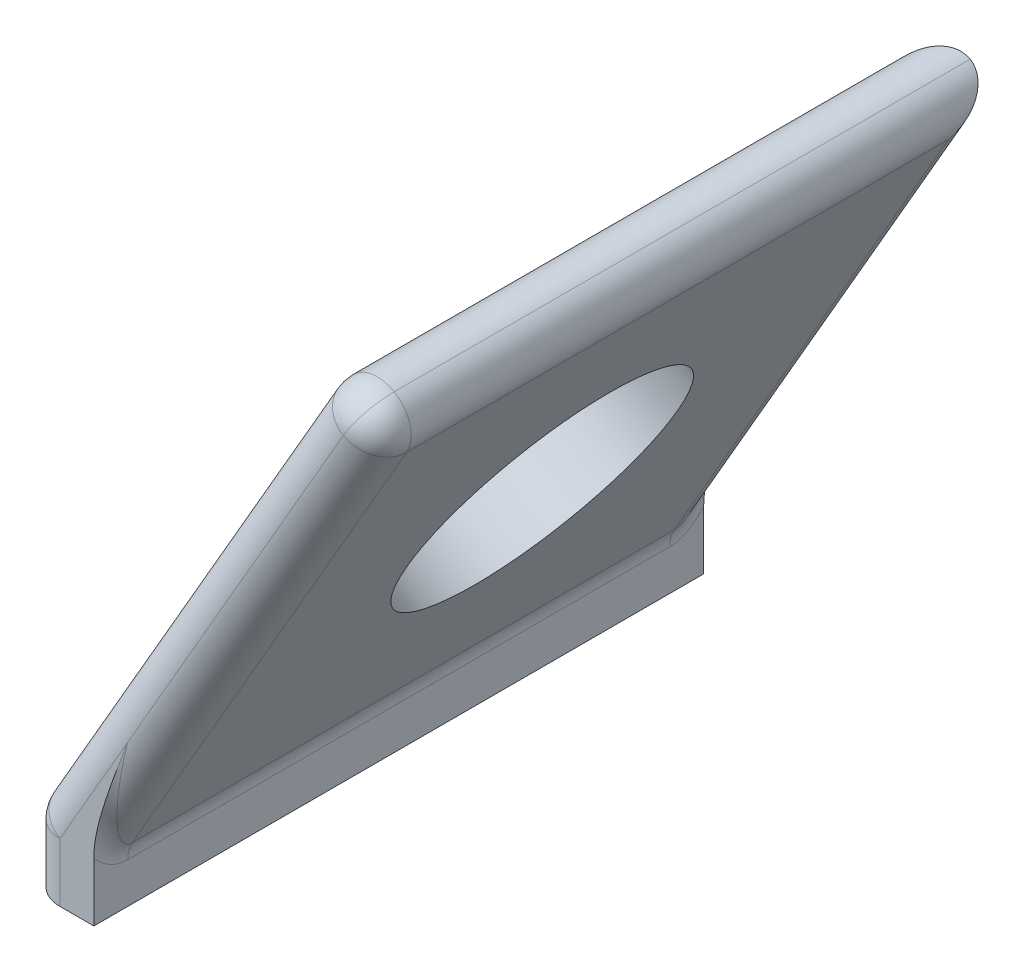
ISO-10303-21;
HEADER;
FILE_DESCRIPTION(('STEP AP214'),'2;1');
FILE_NAME('part.step','',(''),(''),'','','');
FILE_SCHEMA(('AUTOMOTIVE_DESIGN { 1 0 10303 214 1 1 1 1 }'));
ENDSEC;
DATA;
#1=APPLICATION_CONTEXT('core data for automotive mechanical design processes');
#2=APPLICATION_PROTOCOL_DEFINITION('international standard','automotive_design',2000,#1);
#3=PRODUCT_CONTEXT('',#1,'mechanical');
#4=PRODUCT('Part','Part','',(#3));
#5=PRODUCT_RELATED_PRODUCT_CATEGORY('part','',(#4));
#6=PRODUCT_DEFINITION_FORMATION('','',#4);
#7=PRODUCT_DEFINITION_CONTEXT('part definition',#1,'design');
#8=PRODUCT_DEFINITION('design','',#6,#7);
#9=PRODUCT_DEFINITION_SHAPE('','',#8);
#10=(LENGTH_UNIT() NAMED_UNIT(*) SI_UNIT(.MILLI.,.METRE.));
#11=(NAMED_UNIT(*) PLANE_ANGLE_UNIT() SI_UNIT($,.RADIAN.));
#12=(NAMED_UNIT(*) SI_UNIT($,.STERADIAN.) SOLID_ANGLE_UNIT());
#13=UNCERTAINTY_MEASURE_WITH_UNIT(LENGTH_MEASURE(1.E-05),#10,'distance_accuracy_value','');
#14=(GEOMETRIC_REPRESENTATION_CONTEXT(3) GLOBAL_UNCERTAINTY_ASSIGNED_CONTEXT((#13)) GLOBAL_UNIT_ASSIGNED_CONTEXT((#10,
#11,#12)) REPRESENTATION_CONTEXT('',''));
#15=CARTESIAN_POINT('',(0.,0.,0.));
#16=DIRECTION('',(0.,0.,1.));
#17=DIRECTION('',(1.,0.,0.));
#18=AXIS2_PLACEMENT_3D('',#15,#16,#17);
#19=CARTESIAN_POINT('',(1.,0.,-9.));
#20=DIRECTION('',(0.,-1.,0.));
#21=DIRECTION('',(1.,0.,0.));
#22=AXIS2_PLACEMENT_3D('',#19,#20,#21);
#23=PLANE('',#22);
#24=DIRECTION('',(0.,0.,1.));
#25=VECTOR('',#24,1.);
#26=CARTESIAN_POINT('',(0.,0.,-9.));
#27=LINE('',#26,#25);
#28=CARTESIAN_POINT('',(0.,0.,-8.5));
#29=VERTEX_POINT('',#28);
#30=CARTESIAN_POINT('',(0.,0.,-0.499999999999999));
#31=VERTEX_POINT('',#30);
#32=EDGE_CURVE('E156',#29,#31,#27,.T.);
#33=ORIENTED_EDGE('',*,*,#32,.F.);
#34=CARTESIAN_POINT('',(0.5,0.,-8.5));
#35=DIRECTION('',(0.,-1.,0.));
#36=DIRECTION('',(1.,0.,0.));
#37=AXIS2_PLACEMENT_3D('',#34,#35,#36);
#38=CIRCLE('',#37,0.5);
#39=CARTESIAN_POINT('',(0.5,0.,-9.));
#40=VERTEX_POINT('',#39);
#41=EDGE_CURVE('E142',#29,#40,#38,.T.);
#42=ORIENTED_EDGE('',*,*,#41,.T.);
#43=DIRECTION('',(1.,0.,0.));
#44=VECTOR('',#43,1.);
#45=CARTESIAN_POINT('',(1.,0.,-9.));
#46=LINE('',#45,#44);
#47=CARTESIAN_POINT('',(1.,0.,-9.));
#48=VERTEX_POINT('',#47);
#49=EDGE_CURVE('E136',#40,#48,#46,.T.);
#50=ORIENTED_EDGE('',*,*,#49,.T.);
#51=DIRECTION('',(0.,0.,1.));
#52=VECTOR('',#51,1.);
#53=CARTESIAN_POINT('',(1.,0.,-9.));
#54=LINE('',#53,#52);
#55=CARTESIAN_POINT('',(1.,0.,0.));
#56=VERTEX_POINT('',#55);
#57=EDGE_CURVE('E140',#48,#56,#54,.T.);
#58=ORIENTED_EDGE('',*,*,#57,.T.);
#59=DIRECTION('',(1.,0.,0.));
#60=VECTOR('',#59,1.);
#61=CARTESIAN_POINT('',(1.,0.,0.));
#62=LINE('',#61,#60);
#63=CARTESIAN_POINT('',(0.5,0.,0.));
#64=VERTEX_POINT('',#63);
#65=EDGE_CURVE('E163',#64,#56,#62,.T.);
#66=ORIENTED_EDGE('',*,*,#65,.F.);
#67=CARTESIAN_POINT('',(0.5,0.,-0.5));
#68=DIRECTION('',(0.,-1.,0.));
#69=DIRECTION('',(1.,0.,0.));
#70=AXIS2_PLACEMENT_3D('',#67,#68,#69);
#71=CIRCLE('',#70,0.5);
#72=EDGE_CURVE('E236',#64,#31,#71,.T.);
#73=ORIENTED_EDGE('',*,*,#72,.T.);
#74=EDGE_LOOP('',(#33,#42,#50,#58,#66,#73));
#75=FACE_BOUND('',#74,.T.);
#76=ADVANCED_FACE('F35',(#75),#23,.T.);
#77=CARTESIAN_POINT('',(0.,0.,-9.));
#78=DIRECTION('',(-1.,0.,0.));
#79=DIRECTION('',(0.,0.,1.));
#80=AXIS2_PLACEMENT_3D('',#77,#78,#79);
#81=PLANE('',#80);
#82=DIRECTION('',(0.,0.,1.));
#83=VECTOR('',#82,1.);
#84=CARTESIAN_POINT('',(0.,0.866025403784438,-9.));
#85=LINE('',#84,#83);
#86=CARTESIAN_POINT('',(0.,0.866025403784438,-0.5));
#87=VERTEX_POINT('',#86);
#88=CARTESIAN_POINT('',(0.,0.866025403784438,-8.5));
#89=VERTEX_POINT('',#88);
#90=EDGE_CURVE('E229',#87,#89,#85,.F.);
#91=ORIENTED_EDGE('',*,*,#90,.T.);
#92=DIRECTION('',(0.,-1.,0.));
#93=VECTOR('',#92,1.);
#94=CARTESIAN_POINT('',(0.,0.,-8.5));
#95=LINE('',#94,#93);
#96=EDGE_CURVE('E233',#89,#29,#95,.T.);
#97=ORIENTED_EDGE('',*,*,#96,.T.);
#98=ORIENTED_EDGE('',*,*,#32,.T.);
#99=DIRECTION('',(0.,-1.,0.));
#100=VECTOR('',#99,1.);
#101=CARTESIAN_POINT('',(0.,0.,-0.5));
#102=LINE('',#101,#100);
#103=EDGE_CURVE('E231',#31,#87,#102,.F.);
#104=ORIENTED_EDGE('',*,*,#103,.T.);
#105=EDGE_LOOP('',(#91,#97,#98,#104));
#106=FACE_BOUND('',#105,.T.);
#107=ADVANCED_FACE('F323',(#106),#81,.T.);
#108=CARTESIAN_POINT('',(0.,1.,-9.));
#109=DIRECTION('',(-0.866025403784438,0.500000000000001,0.));
#110=DIRECTION('',(-0.500000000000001,-0.866025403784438,0.));
#111=AXIS2_PLACEMENT_3D('',#108,#109,#110);
#112=PLANE('',#111);
#113=CARTESIAN_POINT('',(2.25000000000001,4.89711431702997,-4.5));
#114=DIRECTION('',(-0.866025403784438,0.500000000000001,0.));
#115=DIRECTION('',(-0.500000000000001,-0.866025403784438,0.));
#116=AXIS2_PLACEMENT_3D('',#113,#114,#115);
#117=CIRCLE('',#116,2.);
#118=CARTESIAN_POINT('',(1.25,3.1650635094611,-4.5));
#119=VERTEX_POINT('',#118);
#120=EDGE_CURVE('E172',#119,#119,#117,.T.);
#121=ORIENTED_EDGE('',*,*,#120,.F.);
#122=EDGE_LOOP('',(#121));
#123=FACE_BOUND('',#122,.T.);
#124=DIRECTION('',(-0.500000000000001,-0.866025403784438,0.));
#125=VECTOR('',#124,1.);
#126=CARTESIAN_POINT('',(0.,1.,-8.5));
#127=LINE('',#126,#125);
#128=CARTESIAN_POINT('',(4.25000000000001,8.36121593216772,-8.5));
#129=VERTEX_POINT('',#128);
#130=CARTESIAN_POINT('',(0.066987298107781,1.11602540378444,-8.5));
#131=VERTEX_POINT('',#130);
#132=EDGE_CURVE('E184',#129,#131,#127,.T.);
#133=ORIENTED_EDGE('',*,*,#132,.T.);
#134=DIRECTION('',(0.,0.,1.));
#135=VECTOR('',#134,1.);
#136=CARTESIAN_POINT('',(0.066987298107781,1.11602540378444,-9.));
#137=LINE('',#136,#135);
#138=CARTESIAN_POINT('',(0.0669872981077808,1.11602540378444,-0.5));
#139=VERTEX_POINT('',#138);
#140=EDGE_CURVE('E60',#131,#139,#137,.T.);
#141=ORIENTED_EDGE('',*,*,#140,.T.);
#142=DIRECTION('',(-0.500000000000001,-0.866025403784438,0.));
#143=VECTOR('',#142,1.);
#144=CARTESIAN_POINT('',(4.50000000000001,8.79422863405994,-0.5));
#145=LINE('',#144,#143);
#146=CARTESIAN_POINT('',(4.25000000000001,8.36121593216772,-0.5));
#147=VERTEX_POINT('',#146);
#148=EDGE_CURVE('E180',#139,#147,#145,.F.);
#149=ORIENTED_EDGE('',*,*,#148,.T.);
#150=DIRECTION('',(0.,0.,1.));
#151=VECTOR('',#150,1.);
#152=CARTESIAN_POINT('',(4.25000000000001,8.36121593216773,-9.));
#153=LINE('',#152,#151);
#154=EDGE_CURVE('E182',#147,#129,#153,.F.);
#155=ORIENTED_EDGE('',*,*,#154,.T.);
#156=EDGE_LOOP('',(#133,#141,#149,#155));
#157=FACE_BOUND('',#156,.T.);
#158=ADVANCED_FACE('F327',(#123,#157),#112,.T.);
#159=CARTESIAN_POINT('',(5.36602540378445,8.29422863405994,-9.));
#160=DIRECTION('',(0.866025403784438,-0.500000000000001,0.));
#161=DIRECTION('',(0.500000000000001,0.866025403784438,0.));
#162=AXIS2_PLACEMENT_3D('',#159,#160,#161);
#163=PLANE('',#162);
#164=CARTESIAN_POINT('',(3.11602540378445,4.39711431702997,-4.5));
#165=DIRECTION('',(0.866025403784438,-0.500000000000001,0.));
#166=DIRECTION('',(0.500000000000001,0.866025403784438,0.));
#167=AXIS2_PLACEMENT_3D('',#164,#165,#166);
#168=CIRCLE('',#167,2.);
#169=CARTESIAN_POINT('',(4.11602540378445,6.12916512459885,-4.5));
#170=VERTEX_POINT('',#169);
#171=EDGE_CURVE('E165',#170,#170,#168,.T.);
#172=ORIENTED_EDGE('',*,*,#171,.F.);
#173=EDGE_LOOP('',(#172));
#174=FACE_BOUND('',#173,.T.);
#175=DIRECTION('',(0.500000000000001,0.866025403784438,0.));
#176=VECTOR('',#175,1.);
#177=CARTESIAN_POINT('',(1.,0.732050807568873,-0.5));
#178=LINE('',#177,#176);
#179=CARTESIAN_POINT('',(5.11602540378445,7.86121593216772,-0.5));
#180=VERTEX_POINT('',#179);
#181=CARTESIAN_POINT('',(1.06698729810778,0.848076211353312,-0.5));
#182=VERTEX_POINT('',#181);
#183=EDGE_CURVE('E168',#180,#182,#178,.F.);
#184=ORIENTED_EDGE('',*,*,#183,.T.);
#185=DIRECTION('',(0.,0.,1.));
#186=VECTOR('',#185,1.);
#187=CARTESIAN_POINT('',(1.06698729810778,0.848076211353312,-8.5));
#188=LINE('',#187,#186);
#189=CARTESIAN_POINT('',(1.06698729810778,0.848076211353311,-8.5));
#190=VERTEX_POINT('',#189);
#191=EDGE_CURVE('E243',#182,#190,#188,.F.);
#192=ORIENTED_EDGE('',*,*,#191,.T.);
#193=DIRECTION('',(0.500000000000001,0.866025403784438,0.));
#194=VECTOR('',#193,1.);
#195=CARTESIAN_POINT('',(5.36602540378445,8.29422863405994,-8.5));
#196=LINE('',#195,#194);
#197=CARTESIAN_POINT('',(5.11602540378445,7.86121593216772,-8.5));
#198=VERTEX_POINT('',#197);
#199=EDGE_CURVE('E177',#190,#198,#196,.T.);
#200=ORIENTED_EDGE('',*,*,#199,.T.);
#201=DIRECTION('',(0.,0.,1.));
#202=VECTOR('',#201,1.);
#203=CARTESIAN_POINT('',(5.11602540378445,7.86121593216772,-9.));
#204=LINE('',#203,#202);
#205=EDGE_CURVE('E175',#198,#180,#204,.T.);
#206=ORIENTED_EDGE('',*,*,#205,.T.);
#207=EDGE_LOOP('',(#184,#192,#200,#206));
#208=FACE_BOUND('',#207,.T.);
#209=ADVANCED_FACE('F333',(#174,#208),#163,.T.);
#210=CARTESIAN_POINT('',(1.,0.732050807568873,-9.));
#211=DIRECTION('',(1.,0.,0.));
#212=DIRECTION('',(0.,1.,0.));
#213=AXIS2_PLACEMENT_3D('',#210,#211,#212);
#214=PLANE('',#213);
#215=DIRECTION('',(0.,1.,0.));
#216=VECTOR('',#215,1.);
#217=CARTESIAN_POINT('',(1.,0.732050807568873,-9.));
#218=LINE('',#217,#216);
#219=CARTESIAN_POINT('',(1.,0.866025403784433,-9.));
#220=VERTEX_POINT('',#219);
#221=EDGE_CURVE('E147',#48,#220,#218,.T.);
#222=ORIENTED_EDGE('',*,*,#221,.T.);
#223=CARTESIAN_POINT('',(0.999999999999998,2.5980762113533,-8.5));
#224=DIRECTION('',(1.,0.,0.));
#225=DIRECTION('',(0.,1.,0.));
#226=AXIS2_PLACEMENT_3D('',#223,#224,#225);
#227=ELLIPSE('',#226,1.99999999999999,1.);
#228=CARTESIAN_POINT('',(1.,0.598076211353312,-8.5));
#229=VERTEX_POINT('',#228);
#230=EDGE_CURVE('E220',#220,#229,#227,.F.);
#231=ORIENTED_EDGE('',*,*,#230,.T.);
#232=DIRECTION('',(0.,0.,1.));
#233=VECTOR('',#232,1.);
#234=CARTESIAN_POINT('',(1.,0.598076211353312,-0.5));
#235=LINE('',#234,#233);
#236=CARTESIAN_POINT('',(1.,0.598076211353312,-0.5));
#237=VERTEX_POINT('',#236);
#238=EDGE_CURVE('E186',#229,#237,#235,.T.);
#239=ORIENTED_EDGE('',*,*,#238,.T.);
#240=CARTESIAN_POINT('',(0.999999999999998,2.5980762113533,-0.5));
#241=DIRECTION('',(1.,0.,0.));
#242=DIRECTION('',(0.,-1.,0.));
#243=AXIS2_PLACEMENT_3D('',#240,#241,#242);
#244=ELLIPSE('',#243,1.99999999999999,1.);
#245=CARTESIAN_POINT('',(1.,0.866025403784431,0.));
#246=VERTEX_POINT('',#245);
#247=EDGE_CURVE('E218',#237,#246,#244,.F.);
#248=ORIENTED_EDGE('',*,*,#247,.T.);
#249=DIRECTION('',(0.,1.,0.));
#250=VECTOR('',#249,1.);
#251=CARTESIAN_POINT('',(1.,0.732050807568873,0.));
#252=LINE('',#251,#250);
#253=EDGE_CURVE('E148',#56,#246,#252,.T.);
#254=ORIENTED_EDGE('',*,*,#253,.F.);
#255=ORIENTED_EDGE('',*,*,#57,.F.);
#256=EDGE_LOOP('',(#222,#231,#239,#248,#254,#255));
#257=FACE_BOUND('',#256,.T.);
#258=ADVANCED_FACE('F152',(#257),#214,.T.);
#259=CARTESIAN_POINT('',(0.,0.,-9.));
#260=DIRECTION('',(0.,0.,-1.));
#261=DIRECTION('',(-1.,0.,0.));
#262=AXIS2_PLACEMENT_3D('',#259,#260,#261);
#263=PLANE('',#262);
#264=ORIENTED_EDGE('',*,*,#49,.F.);
#265=DIRECTION('',(0.,-1.,0.));
#266=VECTOR('',#265,1.);
#267=CARTESIAN_POINT('',(0.5,0.,-9.));
#268=LINE('',#267,#266);
#269=CARTESIAN_POINT('',(0.499999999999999,0.866025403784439,-9.));
#270=VERTEX_POINT('',#269);
#271=EDGE_CURVE('E239',#40,#270,#268,.F.);
#272=ORIENTED_EDGE('',*,*,#271,.T.);
#273=DIRECTION('',(-0.500000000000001,-0.866025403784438,0.));
#274=VECTOR('',#273,1.);
#275=CARTESIAN_POINT('',(0.,0.,-9.));
#276=LINE('',#275,#274);
#277=CARTESIAN_POINT('',(1.5,2.59807621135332,-9.));
#278=VERTEX_POINT('',#277);
#279=EDGE_CURVE('E192',#270,#278,#276,.F.);
#280=ORIENTED_EDGE('',*,*,#279,.T.);
#281=CARTESIAN_POINT('',(1.93301270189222,4.3480762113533,-8.5));
#282=CARTESIAN_POINT('',(1.74118095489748,4.01581387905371,-8.5));
#283=CARTESIAN_POINT('',(1.37059047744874,4.11511329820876,-8.5));
#284=CARTESIAN_POINT('',(0.999999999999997,4.21441271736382,-8.5));
#285=CARTESIAN_POINT('',(0.999999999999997,4.5980762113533,-8.5));
#286=CARTESIAN_POINT('',(1.93301270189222,4.3480762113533,-8.48899994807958));
#287=CARTESIAN_POINT('',(1.74118095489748,4.01581387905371,-8.50361752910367));
#288=CARTESIAN_POINT('',(1.37059047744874,4.11511329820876,-8.49924828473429));
#289=CARTESIAN_POINT('',(0.999999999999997,4.21441271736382,-8.49487919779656));
#290=CARTESIAN_POINT('',(0.999999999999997,4.5980762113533,-8.47799989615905));
#291=CARTESIAN_POINT('',(1.93269680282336,4.34679952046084,-8.47799989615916));
#292=CARTESIAN_POINT('',(1.74056911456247,4.01598134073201,-8.50723329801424));
#293=CARTESIAN_POINT('',(1.37028426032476,4.11515998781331,-8.49849656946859));
#294=CARTESIAN_POINT('',(0.999999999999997,4.21433855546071,-8.48976088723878));
#295=CARTESIAN_POINT('',(0.999999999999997,4.5966171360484,-8.4559997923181));
#296=CARTESIAN_POINT('',(1.93145106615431,4.34176493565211,-8.45618763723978));
#297=CARTESIAN_POINT('',(1.73817942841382,4.01646645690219,-8.51350018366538));
#298=CARTESIAN_POINT('',(1.36908944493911,4.11517222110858,-8.49613679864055));
#299=CARTESIAN_POINT('',(0.999999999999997,4.21387805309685,-8.47877460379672));
#300=CARTESIAN_POINT('',(0.999999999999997,4.59086332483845,-8.41237527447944));
#301=CARTESIAN_POINT('',(1.93052112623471,4.3380066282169,-8.44537546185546));
#302=CARTESIAN_POINT('',(1.73640359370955,4.01678377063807,-8.51614916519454));
#303=CARTESIAN_POINT('',(1.36820074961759,4.11513775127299,-8.49452860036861));
#304=CARTESIAN_POINT('',(0.999999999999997,4.21349216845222,-8.47291227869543));
#305=CARTESIAN_POINT('',(0.999999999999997,4.58656811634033,-8.39075092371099));
#306=CARTESIAN_POINT('',(1.92803682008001,4.32796642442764,-8.42358532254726));
#307=CARTESIAN_POINT('',(1.7317322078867,4.01712189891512,-8.51990025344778));
#308=CARTESIAN_POINT('',(1.36586499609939,4.11454800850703,-8.48976834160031));
#309=CARTESIAN_POINT('',(0.999999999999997,4.2119747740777,-8.45964097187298));
#310=CARTESIAN_POINT('',(0.999999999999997,4.57509359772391,-8.34717064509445));
#311=CARTESIAN_POINT('',(1.92645450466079,4.32157157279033,-8.41262450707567));
#312=CARTESIAN_POINT('',(1.7287906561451,4.01712816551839,-8.52092347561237));
#313=CARTESIAN_POINT('',(1.36439307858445,4.1139677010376,-8.48654557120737));
#314=CARTESIAN_POINT('',(0.999999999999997,4.21081023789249,-8.45217869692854));
#315=CARTESIAN_POINT('',(0.999999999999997,4.56778519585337,-8.32524901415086));
#316=CARTESIAN_POINT('',(1.92274468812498,4.30657852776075,-8.39120981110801));
#317=CARTESIAN_POINT('',(1.72203561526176,4.01622345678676,-8.52089326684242));
#318=CARTESIAN_POINT('',(1.36101558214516,4.11171314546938,-8.47831874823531));
#319=CARTESIAN_POINT('',(0.999999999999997,4.20720580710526,-8.43575499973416));
#320=CARTESIAN_POINT('',(0.999999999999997,4.55065028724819,-8.2824196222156));
#321=CARTESIAN_POINT('',(1.92061703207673,4.29797970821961,-8.38075607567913));
#322=CARTESIAN_POINT('',(1.71822643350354,4.01531494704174,-8.51984474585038));
#323=CARTESIAN_POINT('',(1.35910987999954,4.11003858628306,-8.47331418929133));
#324=CARTESIAN_POINT('',(0.999999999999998,4.20477012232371,-8.42680258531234));
#325=CARTESIAN_POINT('',(0.999999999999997,4.54082306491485,-8.26151215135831));
#326=CARTESIAN_POINT('',(1.91570328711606,4.27812104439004,-8.3595802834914));
#327=CARTESIAN_POINT('',(1.70963458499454,4.01200280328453,-8.51562343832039));
#328=CARTESIAN_POINT('',(1.3548134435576,4.10499561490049,-8.46119505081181));
#329=CARTESIAN_POINT('',(0.999999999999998,4.19799739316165,-8.40678823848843));
#330=CARTESIAN_POINT('',(0.999999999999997,4.51812744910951,-8.21916056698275));
#331=CARTESIAN_POINT('',(1.91287718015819,4.26669946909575,-8.34890809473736));
#332=CARTESIAN_POINT('',(1.70480093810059,4.00948699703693,-8.51228961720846));
#333=CARTESIAN_POINT('',(1.3523955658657,4.10149803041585,-8.4539397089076));
#334=CARTESIAN_POINT('',(0.999999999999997,4.19352647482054,-8.3956206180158));
#335=CARTESIAN_POINT('',(0.999999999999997,4.50507422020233,-8.19781618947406));
#336=CARTESIAN_POINT('',(1.90677844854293,4.24205173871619,-8.3282614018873));
#337=CARTESIAN_POINT('',(1.69464521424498,4.00257473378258,-8.50374114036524));
#338=CARTESIAN_POINT('',(1.34731759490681,4.09252097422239,-8.43793616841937));
#339=CARTESIAN_POINT('',(0.999999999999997,4.18248486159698,-8.37216287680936));
#340=CARTESIAN_POINT('',(0.999999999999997,4.47690538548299,-8.15652280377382));
#341=CARTESIAN_POINT('',(1.90350536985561,4.22882374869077,-8.31828762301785));
#342=CARTESIAN_POINT('',(1.68932625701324,3.99818484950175,-8.49853333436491));
#343=CARTESIAN_POINT('',(1.34465725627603,4.08703947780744,-8.42918644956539));
#344=CARTESIAN_POINT('',(0.999999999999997,4.17592206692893,-8.35987994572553));
#345=CARTESIAN_POINT('',(0.999999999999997,4.46178768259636,-8.13657524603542));
#346=CARTESIAN_POINT('',(1.8924622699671,4.18419359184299,-8.28749897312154));
#347=CARTESIAN_POINT('',(1.67190809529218,3.9810482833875,-8.47972014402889));
#348=CARTESIAN_POINT('',(1.33592725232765,4.06627614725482,-8.39959783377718));
#349=CARTESIAN_POINT('',(0.999999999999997,4.15163140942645,-8.31965590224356));
#350=CARTESIAN_POINT('',(0.999999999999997,4.41078178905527,-8.07499794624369));
#351=CARTESIAN_POINT('',(1.88400037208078,4.14999523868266,-8.26800278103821));
#352=CARTESIAN_POINT('',(1.65923808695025,3.96456652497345,-8.46347632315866));
#353=CARTESIAN_POINT('',(1.3295895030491,4.04711850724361,-8.37682822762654));
#354=CARTESIAN_POINT('',(0.999999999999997,4.12988989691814,-8.29039578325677));
#355=CARTESIAN_POINT('',(0.999999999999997,4.37169795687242,-8.03600556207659));
#356=CARTESIAN_POINT('',(1.86508445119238,4.07354745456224,-8.23016665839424));
#357=CARTESIAN_POINT('',(1.63249305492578,3.92148931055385,-8.42673298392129));
#358=CARTESIAN_POINT('',(1.31620977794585,3.99840633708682,-8.32791191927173));
#359=CARTESIAN_POINT('',(0.999999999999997,4.07558625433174,-8.22935994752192));
#360=CARTESIAN_POINT('',(0.999999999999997,4.2843290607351,-7.96033331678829));
#361=CARTESIAN_POINT('',(1.85451535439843,4.03083295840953,-8.2121458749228));
#362=CARTESIAN_POINT('',(1.61839270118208,3.89410741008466,-8.4059778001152));
#363=CARTESIAN_POINT('',(1.30916172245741,3.9679927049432,-8.30165724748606));
#364=CARTESIAN_POINT('',(0.999999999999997,4.04221592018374,-8.19759203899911));
#365=CARTESIAN_POINT('',(0.999999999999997,4.23551249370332,-7.92429174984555));
#366=CARTESIAN_POINT('',(1.83151861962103,3.9378927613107,-8.17754259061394));
#367=CARTESIAN_POINT('',(1.58933613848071,3.8293624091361,-8.36237166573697));
#368=CARTESIAN_POINT('',(1.29462689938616,3.89698083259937,-8.24790460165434));
#369=CARTESIAN_POINT('',(0.999999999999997,3.96500201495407,-8.13374288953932));
#370=CARTESIAN_POINT('',(0.999999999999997,4.12929512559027,-7.85508518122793));
#371=CARTESIAN_POINT('',(1.81900964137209,3.88733832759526,-8.16125352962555));
#372=CARTESIAN_POINT('',(1.5743957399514,3.79134114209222,-8.33947476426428));
#373=CARTESIAN_POINT('',(1.28716098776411,3.85569489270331,-8.22052098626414));
#374=CARTESIAN_POINT('',(0.999999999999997,3.92049634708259,-8.10183099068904));
#375=CARTESIAN_POINT('',(0.999999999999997,4.07151862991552,-7.82250705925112));
#376=CARTESIAN_POINT('',(1.7923159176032,3.77945692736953,-8.13043088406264));
#377=CARTESIAN_POINT('',(1.54408921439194,3.70605741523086,-8.29331279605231));
#378=CARTESIAN_POINT('',(1.27200162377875,3.76373457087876,-8.16622314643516));
#379=CARTESIAN_POINT('',(0.999999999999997,3.82193297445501,-8.03944187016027));
#380=CARTESIAN_POINT('',(0.999999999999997,3.94822560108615,-7.76086176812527));
#381=CARTESIAN_POINT('',(1.77807773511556,3.72191399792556,-8.11614917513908));
#382=CARTESIAN_POINT('',(1.52875360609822,3.65829526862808,-8.27011462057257));
#383=CARTESIAN_POINT('',(1.26433935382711,3.71256889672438,-8.1395297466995));
#384=CARTESIAN_POINT('',(0.999999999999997,3.76737990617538,-8.00919572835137));
#385=CARTESIAN_POINT('',(0.999999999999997,3.88246225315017,-7.73229835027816));
#386=CARTESIAN_POINT('',(1.74814289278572,3.60093377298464,-8.0896272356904));
#387=CARTESIAN_POINT('',(1.49797907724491,3.55462089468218,-8.22468557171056));
#388=CARTESIAN_POINT('',(1.24894723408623,3.6019860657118,-8.08792774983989));
#389=CARTESIAN_POINT('',(0.999999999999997,3.6499598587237,-7.95145383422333));
#390=CARTESIAN_POINT('',(0.999999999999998,3.74419913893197,-7.67925447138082));
#391=CARTESIAN_POINT('',(1.73241282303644,3.53736145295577,-8.07759127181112));
#392=CARTESIAN_POINT('',(1.4825692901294,3.49835054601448,-8.20256319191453));
#393=CARTESIAN_POINT('',(1.24124807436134,3.5422445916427,-8.06326314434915));
#394=CARTESIAN_POINT('',(0.999999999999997,3.58674088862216,-7.92418492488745));
#395=CARTESIAN_POINT('',(0.999999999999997,3.67154505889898,-7.65518254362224));
#396=CARTESIAN_POINT('',(1.6997454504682,3.40533783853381,-8.05581372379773));
#397=CARTESIAN_POINT('',(1.45189948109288,3.37893891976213,-8.1603154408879));
#398=CARTESIAN_POINT('',(1.22590952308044,3.41583380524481,-8.01672807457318));
#399=CARTESIAN_POINT('',(0.999999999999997,3.45339214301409,-7.87338481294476));
#400=CARTESIAN_POINT('',(0.999999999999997,3.52066092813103,-7.61162744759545));
#401=CARTESIAN_POINT('',(1.6827886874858,3.33680789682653,-8.04623011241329));
#402=CARTESIAN_POINT('',(1.43666059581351,3.31555071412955,-8.14029827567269));
#403=CARTESIAN_POINT('',(1.21829555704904,3.34896473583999,-7.99507886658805));
#404=CARTESIAN_POINT('',(0.999999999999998,3.3830202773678,-7.85004274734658));
#405=CARTESIAN_POINT('',(0.999999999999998,3.44234099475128,-7.59246022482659));
#406=CARTESIAN_POINT('',(1.64794551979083,3.19599091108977,-8.02956542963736));
#407=CARTESIAN_POINT('',(1.40653383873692,3.18329813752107,-8.10305170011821));
#408=CARTESIAN_POINT('',(1.20322974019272,3.20973808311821,-7.95534088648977));
#409=CARTESIAN_POINT('',(0.999999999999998,3.2368657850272,-7.80782617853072));
#410=CARTESIAN_POINT('',(0.999999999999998,3.2814072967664,-7.55913085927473));
#411=CARTESIAN_POINT('',(1.63004896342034,3.12366283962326,-8.0225990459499));
#412=CARTESIAN_POINT('',(1.39165724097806,3.11427031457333,-8.08590765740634));
#413=CARTESIAN_POINT('',(1.19579638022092,3.13726798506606,-7.93742796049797));
#414=CARTESIAN_POINT('',(0.999999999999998,3.16092197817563,-7.78908812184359));
#415=CARTESIAN_POINT('',(0.999999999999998,3.19874664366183,-7.54519809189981));
#416=CARTESIAN_POINT('',(1.59362414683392,2.97645369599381,-8.01132947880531));
#417=CARTESIAN_POINT('',(1.36241913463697,2.97220384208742,-8.05500637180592));
#418=CARTESIAN_POINT('',(1.18117594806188,2.98834911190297,-7.90573286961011));
#419=CARTESIAN_POINT('',(0.999999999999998,3.0051797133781,-7.75660505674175));
#420=CARTESIAN_POINT('',(0.999999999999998,3.03050762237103,-7.52265895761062));
#421=CARTESIAN_POINT('',(1.57509161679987,2.90155536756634,-8.00710081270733));
#422=CARTESIAN_POINT('',(1.34805947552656,2.89906259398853,-8.04129977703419));
#423=CARTESIAN_POINT('',(1.17400042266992,2.91184584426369,-7.89207115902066));
#424=CARTESIAN_POINT('',(0.999999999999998,2.92527807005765,-7.74293783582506));
#425=CARTESIAN_POINT('',(0.999999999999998,2.94490953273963,-7.51420162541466));
#426=CARTESIAN_POINT('',(1.53770674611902,2.75046621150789,-8.0014177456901));
#427=CARTESIAN_POINT('',(1.31999144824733,2.75027567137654,-8.01771195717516));
#428=CARTESIAN_POINT('',(1.1599659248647,2.75641036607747,-7.86928377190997));
#429=CARTESIAN_POINT('',(0.999999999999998,2.76320549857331,-7.72095225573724));
#430=CARTESIAN_POINT('',(0.999999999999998,2.77223621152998,-7.50283549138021));
#431=CARTESIAN_POINT('',(1.51885337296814,2.67427121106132,-8.00000000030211));
#432=CARTESIAN_POINT('',(1.30627679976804,2.67457007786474,-8.00784010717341));
#433=CARTESIAN_POINT('',(1.15311225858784,2.67745952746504,-7.86021916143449));
#434=CARTESIAN_POINT('',(0.999999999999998,2.68097135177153,-7.71265060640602));
#435=CARTESIAN_POINT('',(0.999999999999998,2.68515621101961,-7.50000000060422));
#436=CARTESIAN_POINT('',(1.48114662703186,2.52188121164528,-7.99999999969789));
#437=CARTESIAN_POINT('',(1.2796137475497,2.52217738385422,-7.99222088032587));
#438=CARTESIAN_POINT('',(1.13978096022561,2.51869289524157,-7.84688761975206));
#439=CARTESIAN_POINT('',(0.999999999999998,2.51582590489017,-7.70160608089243));
#440=CARTESIAN_POINT('',(0.999999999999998,2.51099621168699,-7.49999999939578));
#441=CARTESIAN_POINT('',(1.46229325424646,2.44568621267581,-8.00141774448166));
#442=CARTESIAN_POINT('',(1.2666523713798,2.44545768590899,-7.98643741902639));
#443=CARTESIAN_POINT('',(1.13330332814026,2.43887710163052,-7.84262068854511));
#444=CARTESIAN_POINT('',(0.999999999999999,2.4328762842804,-7.69881721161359));
#445=CARTESIAN_POINT('',(0.999999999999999,2.42391621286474,-7.50283548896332));
#446=CARTESIAN_POINT('',(1.42490838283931,2.29459705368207,-8.00710081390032));
#447=CARTESIAN_POINT('',(1.24159412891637,2.29255389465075,-7.97916944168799));
#448=CARTESIAN_POINT('',(1.12077496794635,2.27993549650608,-7.83901796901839));
#449=CARTESIAN_POINT('',(0.999999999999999,2.26787795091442,-7.69887909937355));
#450=CARTESIAN_POINT('',(0.999999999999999,2.25124288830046,-7.51420162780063));
#451=CARTESIAN_POINT('',(1.40637585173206,2.21969872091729,-8.01132948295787));
#452=CARTESIAN_POINT('',(1.22947882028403,2.21635042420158,-7.97760000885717));
#453=CARTESIAN_POINT('',(1.11471983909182,2.20081391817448,-7.83961980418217));
#454=CARTESIAN_POINT('',(0.999999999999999,2.18580198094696,-7.70161901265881));
#455=CARTESIAN_POINT('',(0.999999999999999,2.16564479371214,-7.52265896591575));
#456=CARTESIAN_POINT('',(1.36995103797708,2.07248958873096,-8.02259904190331));
#457=CARTESIAN_POINT('',(1.20619754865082,2.06596898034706,-7.97882139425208));
#458=CARTESIAN_POINT('',(1.10308032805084,2.04478448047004,-7.84577215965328));
#459=CARTESIAN_POINT('',(0.999999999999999,2.02409466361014,-7.71270332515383));
#460=CARTESIAN_POINT('',(0.999999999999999,1.99740578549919,-7.54519808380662));
#461=CARTESIAN_POINT('',(1.3520544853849,2.00016153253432,-8.02956541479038));
#462=CARTESIAN_POINT('',(1.19500848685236,1.99177057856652,-7.9814751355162));
#463=CARTESIAN_POINT('',(1.09748787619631,1.96787165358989,-7.85119600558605));
#464=CARTESIAN_POINT('',(0.999999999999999,1.94443299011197,-7.72086880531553));
#465=CARTESIAN_POINT('',(0.999999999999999,1.9147451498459,-7.55913082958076));
#466=CARTESIAN_POINT('',(1.31721130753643,1.85934450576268,-8.04623012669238));
#467=CARTESIAN_POINT('',(1.17365351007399,1.84684147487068,-7.99110085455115));
#468=CARTESIAN_POINT('',(1.08681172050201,1.81773129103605,-7.86690473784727));
#469=CARTESIAN_POINT('',(0.999999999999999,1.78904405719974,-7.74266428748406));
#470=CARTESIAN_POINT('',(0.999999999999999,1.75381140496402,-7.59246025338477));
#471=CARTESIAN_POINT('',(1.30025453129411,1.79081451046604,-8.05581377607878));
#472=CARTESIAN_POINT('',(1.16346010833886,1.77607345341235,-7.99788004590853));
#473=CARTESIAN_POINT('',(1.08171673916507,1.74447532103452,-7.87699575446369));
#474=CARTESIAN_POINT('',(0.999999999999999,1.71326749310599,-7.75604292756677));
#475=CARTESIAN_POINT('',(0.999999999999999,1.67549141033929,-7.61162755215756));
#476=CARTESIAN_POINT('',(1.26758719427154,1.6587910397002,-8.07759122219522));
#477=CARTESIAN_POINT('',(1.14416108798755,1.63938057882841,-8.01562056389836));
#478=CARTESIAN_POINT('',(1.07206862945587,1.60304879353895,-7.90185617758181));
#479=CARTESIAN_POINT('',(0.999999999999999,1.56706635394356,-7.78803031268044));
#480=CARTESIAN_POINT('',(0.999999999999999,1.52460744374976,-7.65518244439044));
#481=CARTESIAN_POINT('',(1.25185717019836,1.59521890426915,-8.08962705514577));
#482=CARTESIAN_POINT('',(1.13502318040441,1.57338258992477,-8.02632985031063));
#483=CARTESIAN_POINT('',(1.06750111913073,1.53480936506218,-7.91636086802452));
#484=CARTESIAN_POINT('',(0.999999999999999,1.49655420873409,-7.80631022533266));
#485=CARTESIAN_POINT('',(0.999999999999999,1.4519535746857,-7.67925411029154));
#486=CARTESIAN_POINT('',(1.22192220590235,1.47423818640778,-8.11614934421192));
#487=CARTESIAN_POINT('',(1.11789221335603,1.44752168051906,-8.05170935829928));
#488=CARTESIAN_POINT('',(1.05893698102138,1.40472777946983,-7.94978091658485));
#489=CARTESIAN_POINT('',(0.999999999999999,1.36221112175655,-7.84778119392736));
#490=CARTESIAN_POINT('',(1.,1.31368989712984,-7.73229868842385));
#491=CARTESIAN_POINT('',(1.20768386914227,1.41669463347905,-8.13043149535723));
#492=CARTESIAN_POINT('',(1.10986080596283,1.38752614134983,-8.06606576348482));
#493=CARTESIAN_POINT('',(1.05492251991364,1.34275464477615,-7.96835746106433));
#494=CARTESIAN_POINT('',(0.999999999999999,1.29822993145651,-7.87056174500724));
#495=CARTESIAN_POINT('',(1.,1.24792583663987,-7.76086299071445));
#496=CARTESIAN_POINT('',(1.18099055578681,1.30881489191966,-8.16125296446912));
#497=CARTESIAN_POINT('',(1.09499384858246,1.27486473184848,-8.09844156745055));
#498=CARTESIAN_POINT('',(1.04749022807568,1.22641583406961,-8.00957759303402));
#499=CARTESIAN_POINT('',(1.,1.17817657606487,-7.92063931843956));
#500=CARTESIAN_POINT('',(1.,1.12463470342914,-7.82250592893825));
#501=CARTESIAN_POINT('',(1.16848208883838,1.25826252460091,-8.17754055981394));
#502=CARTESIAN_POINT('',(1.0881116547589,1.22197701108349,-8.11608643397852));
#503=CARTESIAN_POINT('',(1.04405023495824,1.17182901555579,-8.0318083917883));
#504=CARTESIAN_POINT('',(1.,1.12186052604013,-7.94744433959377));
#505=CARTESIAN_POINT('',(1.,1.06686056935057,-7.85508111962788));
#506=CARTESIAN_POINT('',(1.14548399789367,1.16531684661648,-8.21214773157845));
#507=CARTESIAN_POINT('',(1.07558963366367,1.12461843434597,-8.15467053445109));
#508=CARTESIAN_POINT('',(1.03779017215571,1.07136193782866,-8.07992389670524));
#509=CARTESIAN_POINT('',(1.,1.01825452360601,-8.00510589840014));
#510=CARTESIAN_POINT('',(1.,0.960636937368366,-7.92429546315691));
#511=CARTESIAN_POINT('',(1.13491323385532,1.1225956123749,-8.2301732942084));
#512=CARTESIAN_POINT('',(1.06989175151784,1.07980156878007,-8.17518466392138));
#513=CARTESIAN_POINT('',(1.03494223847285,1.02513647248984,-8.10533180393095));
#514=CARTESIAN_POINT('',(1.,0.970590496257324,-8.03540106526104));
#515=CARTESIAN_POINT('',(1.,0.911812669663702,-7.96034658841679));
#516=CARTESIAN_POINT('',(1.11600172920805,1.04616567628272,-8.26799675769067));
#517=CARTESIAN_POINT('',(1.05978185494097,0.999556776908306,-8.2190676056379));
#518=CARTESIAN_POINT('',(1.02988794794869,0.942373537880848,-8.15931753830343));
#519=CARTESIAN_POINT('',(1.,0.885287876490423,-8.09950398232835));
#520=CARTESIAN_POINT('',(1.,0.824464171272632,-8.03599351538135));
#521=CARTESIAN_POINT('',(1.10754521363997,1.01198907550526,-8.28747752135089));
#522=CARTESIAN_POINT('',(1.0552973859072,0.96362747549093,-8.24199004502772));
#523=CARTESIAN_POINT('',(1.02764663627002,0.905335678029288,-8.18738634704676));
#524=CARTESIAN_POINT('',(1.,0.847112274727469,-8.13271898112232));
#525=CARTESIAN_POINT('',(1.,0.785405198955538,-8.07495504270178));
#526=CARTESIAN_POINT('',(1.09304616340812,0.953391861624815,-8.32790263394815));
#527=CARTESIAN_POINT('',(1.0476552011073,0.902000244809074,-8.29016339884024));
#528=CARTESIAN_POINT('',(1.02382590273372,0.841798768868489,-8.24611949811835));
#529=CARTESIAN_POINT('',(1.,0.781653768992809,-8.20202379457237));
#530=CARTESIAN_POINT('',(1.,0.718436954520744,-8.15580526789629));
#531=CARTESIAN_POINT('',(1.08685361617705,0.928364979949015,-8.348550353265));
#532=CARTESIAN_POINT('',(1.0444111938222,0.875648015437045,-8.31500809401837));
#533=CARTESIAN_POINT('',(1.02220470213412,0.814645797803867,-8.2763119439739));
#534=CARTESIAN_POINT('',(1.,0.753673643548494,-8.23757141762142));
#535=CARTESIAN_POINT('',(1.,0.689834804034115,-8.19710070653));
#536=CARTESIAN_POINT('',(1.07702753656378,0.88865335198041,-8.39091691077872));
#537=CARTESIAN_POINT('',(1.03928380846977,0.83383466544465,-8.36637323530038));
#538=CARTESIAN_POINT('',(1.01964111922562,0.771547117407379,-8.33857801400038));
#539=CARTESIAN_POINT('',(1.,0.709285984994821,-8.31074549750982));
#540=CARTESIAN_POINT('',(1.,0.644450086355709,-8.28183382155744));
#541=CARTESIAN_POINT('',(1.07323246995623,0.873315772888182,-8.41242763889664));
#542=CARTESIAN_POINT('',(1.03731192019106,0.817667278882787,-8.39261934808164));
#543=CARTESIAN_POINT('',(1.0186557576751,0.754894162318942,-8.37032284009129));
#544=CARTESIAN_POINT('',(1.,0.692127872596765,-8.34800453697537));
#545=CARTESIAN_POINT('',(1.,0.62692142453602,-8.32485527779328));
#546=CARTESIAN_POINT('',(1.0682694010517,0.853257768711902,-8.45600733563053));
#547=CARTESIAN_POINT('',(1.03473761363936,0.796533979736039,-8.44596851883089));
#548=CARTESIAN_POINT('',(1.01736858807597,0.733113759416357,-8.43478794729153));
#549=CARTESIAN_POINT('',(1.,0.669700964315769,-8.42358691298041));
#550=CARTESIAN_POINT('',(1.,0.6039979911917,-8.41201467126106));
#551=CARTESIAN_POINT('',(1.06698729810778,0.84807621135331,-8.47800366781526));
#552=CARTESIAN_POINT('',(1.03407417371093,0.791069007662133,-8.47298881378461));
#553=CARTESIAN_POINT('',(1.01703708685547,0.72748573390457,-8.46739397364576));
#554=CARTESIAN_POINT('',(1.,0.663902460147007,-8.46179989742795));
#555=CARTESIAN_POINT('',(1.,0.598076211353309,-8.45600733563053));
#556=CARTESIAN_POINT('',(1.06698729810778,0.84807621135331,-8.52199633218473));
#557=CARTESIAN_POINT('',(1.03407417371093,0.791069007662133,-8.52701118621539));
#558=CARTESIAN_POINT('',(1.01703708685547,0.72748573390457,-8.53260602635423));
#559=CARTESIAN_POINT('',(1.,0.663902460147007,-8.53820010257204));
#560=CARTESIAN_POINT('',(1.,0.598076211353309,-8.54399266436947));
#561=CARTESIAN_POINT('',(1.0682694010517,0.853257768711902,-8.54399266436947));
#562=CARTESIAN_POINT('',(1.03473761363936,0.796533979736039,-8.5540314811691));
#563=CARTESIAN_POINT('',(1.01736858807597,0.733113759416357,-8.56521205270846));
#564=CARTESIAN_POINT('',(1.,0.669700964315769,-8.57641308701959));
#565=CARTESIAN_POINT('',(1.,0.6039979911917,-8.58798532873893));
#566=CARTESIAN_POINT('',(1.07323246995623,0.873315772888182,-8.58757236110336));
#567=CARTESIAN_POINT('',(1.03731192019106,0.817667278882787,-8.60738065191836));
#568=CARTESIAN_POINT('',(1.0186557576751,0.754894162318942,-8.62967715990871));
#569=CARTESIAN_POINT('',(1.,0.692127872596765,-8.65199546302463));
#570=CARTESIAN_POINT('',(1.,0.62692142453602,-8.67514472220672));
#571=CARTESIAN_POINT('',(1.07702753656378,0.88865335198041,-8.60908308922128));
#572=CARTESIAN_POINT('',(1.03928380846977,0.833834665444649,-8.63362676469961));
#573=CARTESIAN_POINT('',(1.01964111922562,0.771547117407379,-8.66142198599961));
#574=CARTESIAN_POINT('',(1.,0.709285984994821,-8.68925450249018));
#575=CARTESIAN_POINT('',(1.,0.644450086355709,-8.71816617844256));
#576=CARTESIAN_POINT('',(1.08685361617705,0.928364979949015,-8.651449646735));
#577=CARTESIAN_POINT('',(1.0444111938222,0.875648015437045,-8.68499190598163));
#578=CARTESIAN_POINT('',(1.02220470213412,0.814645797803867,-8.72368805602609));
#579=CARTESIAN_POINT('',(1.,0.753673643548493,-8.76242858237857));
#580=CARTESIAN_POINT('',(1.,0.689834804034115,-8.80289929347));
#581=CARTESIAN_POINT('',(1.09304616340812,0.953391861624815,-8.67209736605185));
#582=CARTESIAN_POINT('',(1.0476552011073,0.902000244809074,-8.70983660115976));
#583=CARTESIAN_POINT('',(1.02382590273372,0.841798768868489,-8.75388050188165));
#584=CARTESIAN_POINT('',(1.,0.781653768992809,-8.79797620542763));
#585=CARTESIAN_POINT('',(1.,0.718436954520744,-8.8441947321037));
#586=CARTESIAN_POINT('',(1.10754521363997,1.01198907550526,-8.71252247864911));
#587=CARTESIAN_POINT('',(1.0552973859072,0.96362747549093,-8.75800995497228));
#588=CARTESIAN_POINT('',(1.02764663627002,0.905335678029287,-8.81261365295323));
#589=CARTESIAN_POINT('',(1.,0.847112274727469,-8.86728101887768));
#590=CARTESIAN_POINT('',(1.,0.785405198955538,-8.92504495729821));
#591=CARTESIAN_POINT('',(1.11600172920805,1.04616567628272,-8.73200324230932));
#592=CARTESIAN_POINT('',(1.05978185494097,0.999556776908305,-8.78093239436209));
#593=CARTESIAN_POINT('',(1.02988794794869,0.942373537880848,-8.84068246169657));
#594=CARTESIAN_POINT('',(1.,0.885287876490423,-8.90049601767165));
#595=CARTESIAN_POINT('',(1.,0.824464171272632,-8.96400648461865));
#596=CARTESIAN_POINT('',(1.13491323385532,1.1225956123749,-8.7698267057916));
#597=CARTESIAN_POINT('',(1.06989175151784,1.07980156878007,-8.82481533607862));
#598=CARTESIAN_POINT('',(1.03494223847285,1.02513647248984,-8.89466819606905));
#599=CARTESIAN_POINT('',(1.,0.970590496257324,-8.96459893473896));
#600=CARTESIAN_POINT('',(1.,0.911812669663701,-9.0396534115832));
#601=CARTESIAN_POINT('',(1.14548399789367,1.16531684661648,-8.78785226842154));
#602=CARTESIAN_POINT('',(1.07558963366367,1.12461843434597,-8.84532946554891));
#603=CARTESIAN_POINT('',(1.03779017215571,1.07136193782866,-8.92007610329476));
#604=CARTESIAN_POINT('',(1.,1.01825452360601,-8.99489410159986));
#605=CARTESIAN_POINT('',(1.,0.960636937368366,-9.07570453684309));
#606=CARTESIAN_POINT('',(1.16848208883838,1.25826252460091,-8.82245944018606));
#607=CARTESIAN_POINT('',(1.0881116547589,1.22197701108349,-8.88391356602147));
#608=CARTESIAN_POINT('',(1.04405023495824,1.17182901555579,-8.9681916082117));
#609=CARTESIAN_POINT('',(1.,1.12186052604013,-9.05255566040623));
#610=CARTESIAN_POINT('',(1.,1.06686056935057,-9.14491888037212));
#611=CARTESIAN_POINT('',(1.18099055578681,1.30881489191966,-8.83874703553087));
#612=CARTESIAN_POINT('',(1.09499384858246,1.27486473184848,-8.90155843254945));
#613=CARTESIAN_POINT('',(1.04749022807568,1.22641583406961,-8.99042240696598));
#614=CARTESIAN_POINT('',(1.,1.17817657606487,-9.07936068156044));
#615=CARTESIAN_POINT('',(1.,1.12463470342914,-9.17749407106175));
#616=CARTESIAN_POINT('',(1.20768386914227,1.41669463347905,-8.86956850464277));
#617=CARTESIAN_POINT('',(1.10986080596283,1.38752614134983,-8.93393423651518));
#618=CARTESIAN_POINT('',(1.05492251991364,1.34275464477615,-9.03164253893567));
#619=CARTESIAN_POINT('',(0.999999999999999,1.29822993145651,-9.12943825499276));
#620=CARTESIAN_POINT('',(1.,1.24792583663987,-9.23913700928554));
#621=CARTESIAN_POINT('',(1.22192220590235,1.47423818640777,-8.88385065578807));
#622=CARTESIAN_POINT('',(1.11789221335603,1.44752168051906,-8.94829064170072));
#623=CARTESIAN_POINT('',(1.05893698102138,1.40472777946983,-9.05021908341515));
#624=CARTESIAN_POINT('',(1.,1.36221112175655,-9.15221880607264));
#625=CARTESIAN_POINT('',(1.,1.31368989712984,-9.26770131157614));
#626=CARTESIAN_POINT('',(1.25185717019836,1.59521890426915,-8.91037294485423));
#627=CARTESIAN_POINT('',(1.13502318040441,1.57338258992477,-8.97367014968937));
#628=CARTESIAN_POINT('',(1.06750111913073,1.53480936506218,-9.08363913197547));
#629=CARTESIAN_POINT('',(0.999999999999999,1.49655420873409,-9.19368977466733));
#630=CARTESIAN_POINT('',(0.999999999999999,1.4519535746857,-9.32074588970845));
#631=CARTESIAN_POINT('',(1.26758719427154,1.6587910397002,-8.92240877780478));
#632=CARTESIAN_POINT('',(1.14416108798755,1.63938057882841,-8.98437943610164));
#633=CARTESIAN_POINT('',(1.07206862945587,1.60304879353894,-9.09814382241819));
#634=CARTESIAN_POINT('',(0.999999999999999,1.56706635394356,-9.21196968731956));
#635=CARTESIAN_POINT('',(0.999999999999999,1.52460744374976,-9.34481755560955));
#636=CARTESIAN_POINT('',(1.30025453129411,1.79081451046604,-8.94418622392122));
#637=CARTESIAN_POINT('',(1.16346010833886,1.77607345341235,-9.00211995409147));
#638=CARTESIAN_POINT('',(1.08171673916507,1.74447532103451,-9.12300424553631));
#639=CARTESIAN_POINT('',(0.999999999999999,1.71326749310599,-9.24395707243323));
#640=CARTESIAN_POINT('',(0.999999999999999,1.67549141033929,-9.38837244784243));
#641=CARTESIAN_POINT('',(1.31721130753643,1.85934450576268,-8.95376987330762));
#642=CARTESIAN_POINT('',(1.17365351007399,1.84684147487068,-9.00889914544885));
#643=CARTESIAN_POINT('',(1.08681172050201,1.81773129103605,-9.13309526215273));
#644=CARTESIAN_POINT('',(0.999999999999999,1.78904405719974,-9.25733571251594));
#645=CARTESIAN_POINT('',(0.999999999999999,1.75381140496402,-9.40753974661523));
#646=CARTESIAN_POINT('',(1.3520544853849,2.00016153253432,-8.97043458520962));
#647=CARTESIAN_POINT('',(1.19500848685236,1.99177057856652,-9.0185248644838));
#648=CARTESIAN_POINT('',(1.09748787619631,1.96787165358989,-9.14880399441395));
#649=CARTESIAN_POINT('',(0.999999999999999,1.94443299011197,-9.27913119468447));
#650=CARTESIAN_POINT('',(0.999999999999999,1.9147451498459,-9.44086917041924));
#651=CARTESIAN_POINT('',(1.36995103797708,2.07248958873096,-8.97740095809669));
#652=CARTESIAN_POINT('',(1.20619754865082,2.06596898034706,-9.02117860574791));
#653=CARTESIAN_POINT('',(1.10308032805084,2.04478448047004,-9.15422784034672));
#654=CARTESIAN_POINT('',(0.999999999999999,2.02409466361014,-9.28729667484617));
#655=CARTESIAN_POINT('',(0.999999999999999,1.99740578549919,-9.45480191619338));
#656=CARTESIAN_POINT('',(1.40637585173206,2.21969872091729,-8.98867051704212));
#657=CARTESIAN_POINT('',(1.22947882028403,2.21635042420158,-9.02239999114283));
#658=CARTESIAN_POINT('',(1.11471983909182,2.20081391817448,-9.16038019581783));
#659=CARTESIAN_POINT('',(0.999999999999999,2.18580198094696,-9.29838098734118));
#660=CARTESIAN_POINT('',(0.999999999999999,2.16564479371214,-9.47734103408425));
#661=CARTESIAN_POINT('',(1.42490838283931,2.29459705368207,-8.99289918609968));
#662=CARTESIAN_POINT('',(1.24159412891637,2.29255389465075,-9.02083055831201));
#663=CARTESIAN_POINT('',(1.12077496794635,2.27993549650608,-9.16098203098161));
#664=CARTESIAN_POINT('',(0.999999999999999,2.26787795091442,-9.30112090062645));
#665=CARTESIAN_POINT('',(0.999999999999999,2.25124288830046,-9.48579837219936));
#666=CARTESIAN_POINT('',(1.46229325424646,2.44568621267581,-8.99858225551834));
#667=CARTESIAN_POINT('',(1.2666523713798,2.44545768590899,-9.0135625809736));
#668=CARTESIAN_POINT('',(1.13330332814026,2.43887710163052,-9.15737931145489));
#669=CARTESIAN_POINT('',(0.999999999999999,2.4328762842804,-9.30118278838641));
#670=CARTESIAN_POINT('',(0.999999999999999,2.42391621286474,-9.49716451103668));
#671=CARTESIAN_POINT('',(1.48114662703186,2.52188121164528,-9.00000000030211));
#672=CARTESIAN_POINT('',(1.27961374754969,2.52217738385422,-9.00777911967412));
#673=CARTESIAN_POINT('',(1.13978096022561,2.51869289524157,-9.15311238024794));
#674=CARTESIAN_POINT('',(0.999999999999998,2.51582590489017,-9.29839391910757));
#675=CARTESIAN_POINT('',(0.999999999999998,2.51099621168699,-9.50000000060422));
#676=CARTESIAN_POINT('',(1.51885337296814,2.67427121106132,-8.99999999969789));
#677=CARTESIAN_POINT('',(1.30627679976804,2.67457007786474,-8.99215989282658));
#678=CARTESIAN_POINT('',(1.15311225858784,2.67745952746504,-9.13978083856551));
#679=CARTESIAN_POINT('',(0.999999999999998,2.68097135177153,-9.28734939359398));
#680=CARTESIAN_POINT('',(0.999999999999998,2.68515621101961,-9.49999999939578));
#681=CARTESIAN_POINT('',(1.53770674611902,2.75046621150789,-8.99858225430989));
#682=CARTESIAN_POINT('',(1.31999144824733,2.75027567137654,-8.98228804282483));
#683=CARTESIAN_POINT('',(1.1599659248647,2.75641036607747,-9.13071622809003));
#684=CARTESIAN_POINT('',(0.999999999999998,2.76320549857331,-9.27904774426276));
#685=CARTESIAN_POINT('',(0.999999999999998,2.77223621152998,-9.49716450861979));
#686=CARTESIAN_POINT('',(1.57509161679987,2.90155536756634,-8.99289918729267));
#687=CARTESIAN_POINT('',(1.34805947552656,2.89906259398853,-8.95870022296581));
#688=CARTESIAN_POINT('',(1.17400042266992,2.91184584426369,-9.10792884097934));
#689=CARTESIAN_POINT('',(0.999999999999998,2.92527807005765,-9.25706216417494));
#690=CARTESIAN_POINT('',(0.999999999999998,2.94490953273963,-9.48579837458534));
#691=CARTESIAN_POINT('',(1.59362414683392,2.97645369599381,-8.98867052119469));
#692=CARTESIAN_POINT('',(1.36241913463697,2.97220384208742,-8.94499362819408));
#693=CARTESIAN_POINT('',(1.18117594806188,2.98834911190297,-9.09426713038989));
#694=CARTESIAN_POINT('',(0.999999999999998,3.0051797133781,-9.24339494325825));
#695=CARTESIAN_POINT('',(0.999999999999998,3.03050762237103,-9.47734104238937));
#696=CARTESIAN_POINT('',(1.63004896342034,3.12366283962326,-8.97740095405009));
#697=CARTESIAN_POINT('',(1.39165724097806,3.11427031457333,-8.91409234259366));
#698=CARTESIAN_POINT('',(1.19579638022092,3.13726798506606,-9.06257203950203));
#699=CARTESIAN_POINT('',(0.999999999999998,3.16092197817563,-9.2109118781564));
#700=CARTESIAN_POINT('',(0.999999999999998,3.19874664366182,-9.45480190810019));
#701=CARTESIAN_POINT('',(1.64794551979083,3.19599091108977,-8.97043457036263));
#702=CARTESIAN_POINT('',(1.40653383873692,3.18329813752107,-8.89694829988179));
#703=CARTESIAN_POINT('',(1.20322974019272,3.20973808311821,-9.04465911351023));
#704=CARTESIAN_POINT('',(0.999999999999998,3.23686578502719,-9.19217382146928));
#705=CARTESIAN_POINT('',(0.999999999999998,3.2814072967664,-9.44086914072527));
#706=CARTESIAN_POINT('',(1.6827886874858,3.33680789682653,-8.95376988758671));
#707=CARTESIAN_POINT('',(1.43666059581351,3.31555071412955,-8.85970172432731));
#708=CARTESIAN_POINT('',(1.21829555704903,3.34896473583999,-9.00492113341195));
#709=CARTESIAN_POINT('',(0.999999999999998,3.38302027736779,-9.14995725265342));
#710=CARTESIAN_POINT('',(0.999999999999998,3.44234099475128,-9.40753977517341));
#711=CARTESIAN_POINT('',(1.6997454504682,3.40533783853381,-8.94418627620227));
#712=CARTESIAN_POINT('',(1.45189948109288,3.37893891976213,-8.83968455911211));
#713=CARTESIAN_POINT('',(1.22590952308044,3.41583380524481,-8.98327192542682));
#714=CARTESIAN_POINT('',(0.999999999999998,3.45339214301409,-9.12661518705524));
#715=CARTESIAN_POINT('',(0.999999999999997,3.52066092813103,-9.38837255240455));
#716=CARTESIAN_POINT('',(1.73241282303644,3.53736145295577,-8.92240872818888));
#717=CARTESIAN_POINT('',(1.4825692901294,3.49835054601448,-8.79743680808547));
#718=CARTESIAN_POINT('',(1.24124807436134,3.5422445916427,-8.93673685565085));
#719=CARTESIAN_POINT('',(0.999999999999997,3.58674088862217,-9.07581507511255));
#720=CARTESIAN_POINT('',(0.999999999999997,3.67154505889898,-9.34481745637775));
#721=CARTESIAN_POINT('',(1.74814289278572,3.60093377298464,-8.91037276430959));
#722=CARTESIAN_POINT('',(1.49797907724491,3.55462089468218,-8.77531442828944));
#723=CARTESIAN_POINT('',(1.24894723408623,3.6019860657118,-8.9120722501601));
#724=CARTESIAN_POINT('',(0.999999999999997,3.6499598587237,-9.04854616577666));
#725=CARTESIAN_POINT('',(0.999999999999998,3.74419913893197,-9.32074552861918));
#726=CARTESIAN_POINT('',(1.77807773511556,3.72191399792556,-8.88385082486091));
#727=CARTESIAN_POINT('',(1.52875360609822,3.65829526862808,-8.72988537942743));
#728=CARTESIAN_POINT('',(1.26433935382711,3.71256889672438,-8.8604702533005));
#729=CARTESIAN_POINT('',(0.999999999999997,3.76737990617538,-8.99080427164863));
#730=CARTESIAN_POINT('',(0.999999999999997,3.88246225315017,-9.26770164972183));
#731=CARTESIAN_POINT('',(1.7923159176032,3.77945692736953,-8.86956911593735));
#732=CARTESIAN_POINT('',(1.54408921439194,3.70605741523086,-8.70668720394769));
#733=CARTESIAN_POINT('',(1.27200162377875,3.76373457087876,-8.83377685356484));
#734=CARTESIAN_POINT('',(0.999999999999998,3.82193297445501,-8.96055812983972));
#735=CARTESIAN_POINT('',(0.999999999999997,3.94822560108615,-9.23913823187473));
#736=CARTESIAN_POINT('',(1.81900964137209,3.88733832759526,-8.83874647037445));
#737=CARTESIAN_POINT('',(1.57439573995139,3.79134114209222,-8.66052523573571));
#738=CARTESIAN_POINT('',(1.28716098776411,3.85569489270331,-8.77947901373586));
#739=CARTESIAN_POINT('',(0.999999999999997,3.92049634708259,-8.89816900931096));
#740=CARTESIAN_POINT('',(0.999999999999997,4.07151862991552,-9.17749294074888));
#741=CARTESIAN_POINT('',(1.83151861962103,3.9378927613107,-8.82245740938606));
#742=CARTESIAN_POINT('',(1.58933613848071,3.8293624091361,-8.63762833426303));
#743=CARTESIAN_POINT('',(1.29462689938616,3.89698083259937,-8.75209539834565));
#744=CARTESIAN_POINT('',(0.999999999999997,3.96500201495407,-8.86625711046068));
#745=CARTESIAN_POINT('',(0.999999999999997,4.12929512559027,-9.14491481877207));
#746=CARTESIAN_POINT('',(1.85451535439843,4.03083295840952,-8.7878541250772));
#747=CARTESIAN_POINT('',(1.61839270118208,3.89410741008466,-8.5940221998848));
#748=CARTESIAN_POINT('',(1.30916172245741,3.9679927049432,-8.69834275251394));
#749=CARTESIAN_POINT('',(0.999999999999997,4.04221592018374,-8.80240796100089));
#750=CARTESIAN_POINT('',(0.999999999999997,4.23551249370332,-9.07570825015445));
#751=CARTESIAN_POINT('',(1.86508445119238,4.07354745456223,-8.76983334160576));
#752=CARTESIAN_POINT('',(1.63249305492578,3.92148931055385,-8.57326701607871));
#753=CARTESIAN_POINT('',(1.31620977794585,3.99840633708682,-8.67208808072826));
#754=CARTESIAN_POINT('',(0.999999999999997,4.07558625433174,-8.77064005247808));
#755=CARTESIAN_POINT('',(0.999999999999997,4.2843290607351,-9.0396666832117));
#756=CARTESIAN_POINT('',(1.88400037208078,4.14999523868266,-8.73199721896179));
#757=CARTESIAN_POINT('',(1.65923808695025,3.96456652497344,-8.53652367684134));
#758=CARTESIAN_POINT('',(1.3295895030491,4.04711850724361,-8.62317177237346));
#759=CARTESIAN_POINT('',(0.999999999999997,4.12988989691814,-8.70960421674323));
#760=CARTESIAN_POINT('',(0.999999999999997,4.37169795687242,-8.96399443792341));
#761=CARTESIAN_POINT('',(1.8924622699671,4.18419359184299,-8.71250102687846));
#762=CARTESIAN_POINT('',(1.67190809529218,3.98104828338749,-8.52027985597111));
#763=CARTESIAN_POINT('',(1.33592725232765,4.06627614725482,-8.60040216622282));
#764=CARTESIAN_POINT('',(0.999999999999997,4.15163140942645,-8.68034409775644));
#765=CARTESIAN_POINT('',(0.999999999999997,4.41078178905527,-8.92500205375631));
#766=CARTESIAN_POINT('',(1.90350536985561,4.22882374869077,-8.68171237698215));
#767=CARTESIAN_POINT('',(1.68932625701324,3.99818484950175,-8.50146666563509));
#768=CARTESIAN_POINT('',(1.34465725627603,4.08703947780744,-8.57081355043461));
#769=CARTESIAN_POINT('',(0.999999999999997,4.17592206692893,-8.64012005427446));
#770=CARTESIAN_POINT('',(0.999999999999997,4.46178768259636,-8.86342475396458));
#771=CARTESIAN_POINT('',(1.90677844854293,4.24205173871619,-8.6717385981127));
#772=CARTESIAN_POINT('',(1.69464521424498,4.00257473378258,-8.49625885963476));
#773=CARTESIAN_POINT('',(1.34731759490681,4.09252097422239,-8.56206383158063));
#774=CARTESIAN_POINT('',(0.999999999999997,4.18248486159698,-8.62783712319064));
#775=CARTESIAN_POINT('',(0.999999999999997,4.47690538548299,-8.84347719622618));
#776=CARTESIAN_POINT('',(1.91287718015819,4.26669946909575,-8.65109190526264));
#777=CARTESIAN_POINT('',(1.70480093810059,4.00948699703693,-8.48771038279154));
#778=CARTESIAN_POINT('',(1.3523955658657,4.10149803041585,-8.5460602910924));
#779=CARTESIAN_POINT('',(0.999999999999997,4.19352647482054,-8.6043793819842));
#780=CARTESIAN_POINT('',(0.999999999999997,4.50507422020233,-8.80218381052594));
#781=CARTESIAN_POINT('',(1.91570328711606,4.27812104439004,-8.6404197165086));
#782=CARTESIAN_POINT('',(1.70963458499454,4.01200280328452,-8.4843765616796));
#783=CARTESIAN_POINT('',(1.3548134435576,4.10499561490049,-8.53880494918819));
#784=CARTESIAN_POINT('',(0.999999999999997,4.19799739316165,-8.59321176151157));
#785=CARTESIAN_POINT('',(0.999999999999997,4.51812744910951,-8.78083943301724));
#786=CARTESIAN_POINT('',(1.92061703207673,4.29797970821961,-8.61924392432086));
#787=CARTESIAN_POINT('',(1.71822643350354,4.01531494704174,-8.48015525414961));
#788=CARTESIAN_POINT('',(1.35910987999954,4.11003858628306,-8.52668581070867));
#789=CARTESIAN_POINT('',(0.999999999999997,4.20477012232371,-8.57319741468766));
#790=CARTESIAN_POINT('',(0.999999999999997,4.54082306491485,-8.73848784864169));
#791=CARTESIAN_POINT('',(1.92274468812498,4.30657852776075,-8.60879018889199));
#792=CARTESIAN_POINT('',(1.72203561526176,4.01622345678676,-8.47910673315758));
#793=CARTESIAN_POINT('',(1.36101558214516,4.11171314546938,-8.52168125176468));
#794=CARTESIAN_POINT('',(0.999999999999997,4.20720580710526,-8.56424500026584));
#795=CARTESIAN_POINT('',(0.999999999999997,4.55065028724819,-8.71758037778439));
#796=CARTESIAN_POINT('',(1.92645450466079,4.32157157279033,-8.58737549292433));
#797=CARTESIAN_POINT('',(1.7287906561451,4.01712816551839,-8.47907652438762));
#798=CARTESIAN_POINT('',(1.36439307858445,4.1139677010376,-8.51345442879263));
#799=CARTESIAN_POINT('',(0.999999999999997,4.21081023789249,-8.54782130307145));
#800=CARTESIAN_POINT('',(0.999999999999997,4.56778519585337,-8.67475098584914));
#801=CARTESIAN_POINT('',(1.92803682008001,4.32796642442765,-8.57641467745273));
#802=CARTESIAN_POINT('',(1.7317322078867,4.01712189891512,-8.48009974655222));
#803=CARTESIAN_POINT('',(1.36586499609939,4.11454800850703,-8.51023165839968));
#804=CARTESIAN_POINT('',(0.999999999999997,4.2119747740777,-8.54035902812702));
#805=CARTESIAN_POINT('',(0.999999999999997,4.57509359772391,-8.65282935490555));
#806=CARTESIAN_POINT('',(1.93052112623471,4.3380066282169,-8.55462453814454));
#807=CARTESIAN_POINT('',(1.73640359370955,4.01678377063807,-8.48385083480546));
#808=CARTESIAN_POINT('',(1.36820074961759,4.11513775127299,-8.50547139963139));
#809=CARTESIAN_POINT('',(0.999999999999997,4.21349216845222,-8.52708772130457));
#810=CARTESIAN_POINT('',(0.999999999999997,4.58656811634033,-8.60924907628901));
#811=CARTESIAN_POINT('',(1.93145106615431,4.34176493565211,-8.54381236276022));
#812=CARTESIAN_POINT('',(1.73817942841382,4.01646645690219,-8.48649981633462));
#813=CARTESIAN_POINT('',(1.36908944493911,4.11517222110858,-8.50386320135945));
#814=CARTESIAN_POINT('',(0.999999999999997,4.21387805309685,-8.52122539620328));
#815=CARTESIAN_POINT('',(0.999999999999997,4.59086332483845,-8.58762472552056));
#816=CARTESIAN_POINT('',(1.93269680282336,4.34679952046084,-8.52200010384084));
#817=CARTESIAN_POINT('',(1.74056911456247,4.01598134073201,-8.49276670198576));
#818=CARTESIAN_POINT('',(1.37028426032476,4.11515998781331,-8.50150343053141));
#819=CARTESIAN_POINT('',(0.999999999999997,4.21433855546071,-8.51023911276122));
#820=CARTESIAN_POINT('',(0.999999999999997,4.5966171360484,-8.5440002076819));
#821=CARTESIAN_POINT('',(1.93301270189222,4.3480762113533,-8.51100005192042));
#822=CARTESIAN_POINT('',(1.74118095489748,4.01581387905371,-8.49638247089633));
#823=CARTESIAN_POINT('',(1.37059047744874,4.11511329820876,-8.5007517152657));
#824=CARTESIAN_POINT('',(0.999999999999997,4.21441271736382,-8.50512080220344));
#825=CARTESIAN_POINT('',(0.999999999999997,4.5980762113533,-8.52200010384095));
#826=CARTESIAN_POINT('',(1.93301270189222,4.3480762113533,-8.5));
#827=CARTESIAN_POINT('',(1.74118095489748,4.01581387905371,-8.5));
#828=CARTESIAN_POINT('',(1.37059047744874,4.11511329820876,-8.5));
#829=CARTESIAN_POINT('',(0.999999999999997,4.21441271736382,-8.5));
#830=CARTESIAN_POINT('',(0.999999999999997,4.5980762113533,-8.5));
#831=(BOUNDED_SURFACE() B_SPLINE_SURFACE(3,2,((#281,#282,#283,#284,#285),(#286,#287,#288,#289,
#290),(#291,#292,#293,#294,#295),(#296,#297,#298,#299,#300),(#301,#302,#303,#304,#305),(#306,
#307,#308,#309,#310),(#311,#312,#313,#314,#315),(#316,#317,#318,#319,#320),(#321,#322,#323,#324,
#325),(#326,#327,#328,#329,#330),(#331,#332,#333,#334,#335),(#336,#337,#338,#339,#340),(#341,
#342,#343,#344,#345),(#346,#347,#348,#349,#350),(#351,#352,#353,#354,#355),(#356,#357,#358,#359,
#360),(#361,#362,#363,#364,#365),(#366,#367,#368,#369,#370),(#371,#372,#373,#374,#375),(#376,
#377,#378,#379,#380),(#381,#382,#383,#384,#385),(#386,#387,#388,#389,#390),(#391,#392,#393,#394,
#395),(#396,#397,#398,#399,#400),(#401,#402,#403,#404,#405),(#406,#407,#408,#409,#410),(#411,
#412,#413,#414,#415),(#416,#417,#418,#419,#420),(#421,#422,#423,#424,#425),(#426,#427,#428,#429,
#430),(#431,#432,#433,#434,#435),(#436,#437,#438,#439,#440),(#441,#442,#443,#444,#445),(#446,
#447,#448,#449,#450),(#451,#452,#453,#454,#455),(#456,#457,#458,#459,#460),(#461,#462,#463,#464,
#465),(#466,#467,#468,#469,#470),(#471,#472,#473,#474,#475),(#476,#477,#478,#479,#480),(#481,
#482,#483,#484,#485),(#486,#487,#488,#489,#490),(#491,#492,#493,#494,#495),(#496,#497,#498,#499,
#500),(#501,#502,#503,#504,#505),(#506,#507,#508,#509,#510),(#511,#512,#513,#514,#515),(#516,
#517,#518,#519,#520),(#521,#522,#523,#524,#525),(#526,#527,#528,#529,#530),(#531,#532,#533,#534,
#535),(#536,#537,#538,#539,#540),(#541,#542,#543,#544,#545),(#546,#547,#548,#549,#550),(#551,
#552,#553,#554,#555),(#556,#557,#558,#559,#560),(#561,#562,#563,#564,#565),(#566,#567,#568,#569,
#570),(#571,#572,#573,#574,#575),(#576,#577,#578,#579,#580),(#581,#582,#583,#584,#585),(#586,
#587,#588,#589,#590),(#591,#592,#593,#594,#595),(#596,#597,#598,#599,#600),(#601,#602,#603,#604,
#605),(#606,#607,#608,#609,#610),(#611,#612,#613,#614,#615),(#616,#617,#618,#619,#620),(#621,
#622,#623,#624,#625),(#626,#627,#628,#629,#630),(#631,#632,#633,#634,#635),(#636,#637,#638,#639,
#640),(#641,#642,#643,#644,#645),(#646,#647,#648,#649,#650),(#651,#652,#653,#654,#655),(#656,
#657,#658,#659,#660),(#661,#662,#663,#664,#665),(#666,#667,#668,#669,#670),(#671,#672,#673,#674,
#675),(#676,#677,#678,#679,#680),(#681,#682,#683,#684,#685),(#686,#687,#688,#689,#690),(#691,
#692,#693,#694,#695),(#696,#697,#698,#699,#700),(#701,#702,#703,#704,#705),(#706,#707,#708,#709,
#710),(#711,#712,#713,#714,#715),(#716,#717,#718,#719,#720),(#721,#722,#723,#724,#725),(#726,
#727,#728,#729,#730),(#731,#732,#733,#734,#735),(#736,#737,#738,#739,#740),(#741,#742,#743,#744,
#745),(#746,#747,#748,#749,#750),(#751,#752,#753,#754,#755),(#756,#757,#758,#759,#760),(#761,
#762,#763,#764,#765),(#766,#767,#768,#769,#770),(#771,#772,#773,#774,#775),(#776,#777,#778,#779,
#780),(#781,#782,#783,#784,#785),(#786,#787,#788,#789,#790),(#791,#792,#793,#794,#795),(#796,
#797,#798,#799,#800),(#801,#802,#803,#804,#805),(#806,#807,#808,#809,#810),(#811,#812,#813,#814,
#815),(#816,#817,#818,#819,#820),(#821,#822,#823,#824,#825),(#826,#827,#828,#829,#830)),
.UNSPECIFIED.,.T.,.F.,.F.) B_SPLINE_SURFACE_WITH_KNOTS((4,2,2,2,2,2,2,2,2,2,2,2,2,2,2,2,2,2,2,2,
2,2,2,2,2,2,2,2,2,2,2,2,2,2,2,2,2,2,2,2,2,2,2,2,2,2,2,2,2,2,2,2,2,2,4),(3,2,3),(0.,
0.0659533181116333,0.1319176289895,0.201062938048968,0.270227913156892,0.345139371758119,
0.420127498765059,0.584904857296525,0.766437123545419,0.964996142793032,1.17976509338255,
1.40910637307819,1.65076689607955,1.90203853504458,2.1598901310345,2.42108266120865,
2.6822751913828,2.94012678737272,3.19139842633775,3.43305894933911,3.66240022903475,
3.87716917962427,4.07572819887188,4.25726046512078,4.42203782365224,4.57175071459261,
4.70982294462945,4.84146582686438,4.97310870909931,5.11118093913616,5.26089383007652,
5.42567118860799,5.60720345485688,5.8057624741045,6.02053142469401,6.24987270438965,
6.49153322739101,6.74280486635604,7.00065646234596,7.26184899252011,7.52304152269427,
7.78089311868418,8.03216475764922,8.27382528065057,8.50316656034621,8.71793551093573,
8.91649453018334,9.09802679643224,9.26280415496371,9.33779228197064,9.41270374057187,
9.4818687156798,9.55101402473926,9.61697833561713,9.68293165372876),(0.,0.5,1.),
.UNSPECIFIED.) GEOMETRIC_REPRESENTATION_ITEM() RATIONAL_B_SPLINE_SURFACE(((1.,0.793353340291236,
1.,0.793353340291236,1.),(1.,0.793353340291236,1.,0.793353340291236,1.),(1.,0.793546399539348,
1.,0.793546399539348,1.),(1.,0.794298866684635,1.,0.794298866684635,1.),(1.,0.794858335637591,
1.,0.794858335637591,1.),(1.,0.796326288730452,1.,0.796326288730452,1.),(1.,0.797250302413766,
1.,0.797250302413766,1.),(1.,0.799365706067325,1.,0.799365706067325,1.),(1.,0.800557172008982,
1.,0.800557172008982,1.),(1.,0.803236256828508,1.,0.803236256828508,1.),(1.,0.804740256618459,
1.,0.804740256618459,1.),(1.,0.807889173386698,1.,0.807889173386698,1.),(1.,0.809534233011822,
1.,0.809534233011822,1.),(1.,0.814914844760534,1.,0.814914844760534,1.),(1.,0.818794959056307,
1.,0.818794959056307,1.),(1.,0.826927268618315,1.,0.826927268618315,1.),(1.,0.831177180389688,
1.,0.831177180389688,1.),(1.,0.839877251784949,1.,0.839877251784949,1.),(1.,0.844308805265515,
1.,0.844308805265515,1.),(1.,0.853240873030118,1.,0.853240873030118,1.),(1.,0.857717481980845,
1.,0.857717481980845,1.),(1.,0.866645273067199,1.,0.866645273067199,1.),(1.,0.871074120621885,
1.,0.871074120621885,1.),(1.,0.879835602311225,1.,0.879835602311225,1.),(1.,0.884150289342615,
1.,0.884150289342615,1.),(1.,0.892630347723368,1.,0.892630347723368,1.),(1.,0.896782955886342,
1.,0.896782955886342,1.),(1.,0.904898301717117,1.,0.904898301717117,1.),(1.,0.908853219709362,
1.,0.908853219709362,1.),(1.,0.916541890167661,1.,0.916541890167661,1.),(1.,0.920272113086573,
1.,0.920272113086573,1.),(1.,0.927486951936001,1.,0.927486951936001,1.),(1.,0.930971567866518,
1.,0.930971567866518,1.),(1.,0.937675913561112,1.,0.937675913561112,1.),(1.,0.940898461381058,
1.,0.940898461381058,1.),(1.,0.947063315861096,1.,0.947063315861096,1.),(1.,0.950010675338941,
1.,0.950010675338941,1.),(1.,0.955612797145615,1.,0.955612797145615,1.),(1.,0.958274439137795,
1.,0.958274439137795,1.),(1.,0.963295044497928,1.,0.963295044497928,1.),(1.,0.965662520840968,
1.,0.965662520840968,1.),(1.,0.97008638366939,1.,0.97008638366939,1.),(1.,0.97215297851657,1.,
0.97215297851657,1.),(1.,0.975967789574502,1.,0.975967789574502,1.),(1.,0.977728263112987,1.,
0.977728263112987,1.),(1.,0.980924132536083,1.,0.980924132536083,1.),(1.,0.982374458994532,1.,
0.982374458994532,1.),(1.,0.984943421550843,1.,0.984943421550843,1.),(1.,0.986080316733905,1.,
0.986080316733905,1.),(1.,0.988015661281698,1.,0.988015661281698,1.),(1.,0.98883555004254,1.,
0.98883555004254,1.),(1.,0.990130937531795,1.,0.990130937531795,1.),(1.,0.990628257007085,1.,
0.990628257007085,1.),(1.,0.991277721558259,1.,0.991277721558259,1.),(1.,0.99144486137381,1.,
0.99144486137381,1.),(1.,0.99144486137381,1.,0.99144486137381,1.),(1.,0.991277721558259,1.,
0.991277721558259,1.),(1.,0.990628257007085,1.,0.990628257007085,1.),(1.,0.990130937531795,1.,
0.990130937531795,1.),(1.,0.98883555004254,1.,0.98883555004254,1.),(1.,0.988015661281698,1.,
0.988015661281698,1.),(1.,0.986080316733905,1.,0.986080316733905,1.),(1.,0.984943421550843,1.,
0.984943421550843,1.),(1.,0.982374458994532,1.,0.982374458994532,1.),(1.,0.980924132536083,1.,
0.980924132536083,1.),(1.,0.977728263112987,1.,0.977728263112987,1.),(1.,0.975967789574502,1.,
0.975967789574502,1.),(1.,0.97215297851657,1.,0.97215297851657,1.),(1.,0.97008638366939,1.,
0.97008638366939,1.),(1.,0.965662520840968,1.,0.965662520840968,1.),(1.,0.963295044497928,1.,
0.963295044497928,1.),(1.,0.958274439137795,1.,0.958274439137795,1.),(1.,0.955612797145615,1.,
0.955612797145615,1.),(1.,0.950010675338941,1.,0.950010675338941,1.),(1.,0.947063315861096,1.,
0.947063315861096,1.),(1.,0.940898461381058,1.,0.940898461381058,1.),(1.,0.937675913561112,1.,
0.937675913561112,1.),(1.,0.930971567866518,1.,0.930971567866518,1.),(1.,0.927486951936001,1.,
0.927486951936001,1.),(1.,0.920272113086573,1.,0.920272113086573,1.),(1.,0.916541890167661,1.,
0.916541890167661,1.),(1.,0.908853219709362,1.,0.908853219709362,1.),(1.,0.904898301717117,1.,
0.904898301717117,1.),(1.,0.896782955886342,1.,0.896782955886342,1.),(1.,0.892630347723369,1.,
0.892630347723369,1.),(1.,0.884150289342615,1.,0.884150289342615,1.),(1.,0.879835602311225,1.,
0.879835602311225,1.),(1.,0.871074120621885,1.,0.871074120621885,1.),(1.,0.866645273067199,1.,
0.866645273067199,1.),(1.,0.857717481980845,1.,0.857717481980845,1.),(1.,0.853240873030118,1.,
0.853240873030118,1.),(1.,0.844308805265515,1.,0.844308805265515,1.),(1.,0.839877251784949,1.,
0.839877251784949,1.),(1.,0.831177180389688,1.,0.831177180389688,1.),(1.,0.826927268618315,1.,
0.826927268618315,1.),(1.,0.818794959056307,1.,0.818794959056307,1.),(1.,0.814914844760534,1.,
0.814914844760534,1.),(1.,0.809534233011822,1.,0.809534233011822,1.),(1.,0.807889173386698,1.,
0.807889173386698,1.),(1.,0.804740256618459,1.,0.804740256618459,1.),(1.,0.803236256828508,1.,
0.803236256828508,1.),(1.,0.800557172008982,1.,0.800557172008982,1.),(1.,0.799365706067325,1.,
0.799365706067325,1.),(1.,0.797250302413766,1.,0.797250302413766,1.),(1.,0.796326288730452,1.,
0.796326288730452,1.),(1.,0.794858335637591,1.,0.794858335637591,1.),(1.,0.794298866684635,1.,
0.794298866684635,1.),(1.,0.793546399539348,1.,0.793546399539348,1.),(1.,0.793353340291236,1.,
0.793353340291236,1.),(1.,0.793353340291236,1.,0.793353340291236,1.))) REPRESENTATION_ITEM('') SURFACE());
#832=CARTESIAN_POINT('',(1.,0.866025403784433,-9.));
#833=CARTESIAN_POINT('',(1.0000041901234,0.890406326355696,-9.));
#834=CARTESIAN_POINT('',(1.00076395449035,0.914772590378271,-9.));
#835=CARTESIAN_POINT('',(1.00357178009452,0.963410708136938,-9.));
#836=CARTESIAN_POINT('',(1.00561868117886,0.987682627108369,-9.));
#837=CARTESIAN_POINT('',(1.01334131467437,1.06016145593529,-9.));
#838=CARTESIAN_POINT('',(1.02060202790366,1.10819673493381,-9.));
#839=CARTESIAN_POINT('',(1.03798561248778,1.20337610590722,-9.));
#840=CARTESIAN_POINT('',(1.04808862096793,1.25052404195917,-9.));
#841=CARTESIAN_POINT('',(1.07033216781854,1.34438195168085,-9.));
#842=CARTESIAN_POINT('',(1.08247484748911,1.39109141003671,-9.));
#843=CARTESIAN_POINT('',(1.10885063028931,1.486423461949,-9.));
#844=CARTESIAN_POINT('',(1.12315779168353,1.5350252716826,-9.));
#845=CARTESIAN_POINT('',(1.15291193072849,1.63188041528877,-9.));
#846=CARTESIAN_POINT('',(1.16835901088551,1.68013371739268,-9.));
#847=CARTESIAN_POINT('',(1.21592924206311,1.82446641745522,-9.));
#848=CARTESIAN_POINT('',(1.24928660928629,1.92013650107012,-9.));
#849=CARTESIAN_POINT('',(1.35205138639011,2.20681569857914,-9.));
#850=CARTESIAN_POINT('',(1.4239641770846,2.39690772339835,-9.));
#851=CARTESIAN_POINT('',(1.49721117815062,2.59069755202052,-9.));
#852=CARTESIAN_POINT('',(1.49860561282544,2.59438687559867,-9.));
#853=CARTESIAN_POINT('',(1.5,2.59807621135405,-9.));
#854=B_SPLINE_CURVE_WITH_KNOTS('',3,(#832,#833,#834,#835,#836,#837,#838,#839,#840,#841,#842,
#843,#844,#845,#846,#847,#848,#849,#850,#851,#852,#853),.UNSPECIFIED.,.F.,.F.,(4,2,2,2,2,2,2,2,
2,2,4),(0.,0.0731093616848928,0.146152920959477,0.291746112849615,0.436346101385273,
0.581098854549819,0.733071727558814,0.885058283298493,1.18897551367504,1.79865407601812,
1.81048623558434),.UNSPECIFIED.);
#855=EDGE_CURVE('E44',#278,#220,#854,.F.);
#856=ORIENTED_EDGE('',*,*,#855,.T.);
#857=ORIENTED_EDGE('',*,*,#221,.F.);
#858=EDGE_LOOP('',(#264,#272,#280,#856,#857));
#859=FACE_BOUND('',#858,.T.);
#860=ADVANCED_FACE('F158',(#859),#263,.T.);
#861=CARTESIAN_POINT('',(0.,0.,0.));
#862=DIRECTION('',(0.,0.,-1.));
#863=DIRECTION('',(-1.,0.,0.));
#864=AXIS2_PLACEMENT_3D('',#861,#862,#863);
#865=PLANE('',#864);
#866=DIRECTION('',(-0.500000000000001,-0.866025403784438,0.));
#867=VECTOR('',#866,1.);
#868=CARTESIAN_POINT('',(0.433012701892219,0.75,0.));
#869=LINE('',#868,#867);
#870=CARTESIAN_POINT('',(1.5,2.59807621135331,0.));
#871=VERTEX_POINT('',#870);
#872=CARTESIAN_POINT('',(0.5,0.866025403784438,0.));
#873=VERTEX_POINT('',#872);
#874=EDGE_CURVE('E52',#871,#873,#869,.T.);
#875=ORIENTED_EDGE('',*,*,#874,.T.);
#876=DIRECTION('',(0.,-1.,0.));
#877=VECTOR('',#876,1.);
#878=CARTESIAN_POINT('',(0.5,0.,0.));
#879=LINE('',#878,#877);
#880=EDGE_CURVE('E241',#873,#64,#879,.T.);
#881=ORIENTED_EDGE('',*,*,#880,.T.);
#882=ORIENTED_EDGE('',*,*,#65,.T.);
#883=ORIENTED_EDGE('',*,*,#253,.T.);
#884=CARTESIAN_POINT('',(1.06698729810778,0.84807621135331,-0.5));
#885=CARTESIAN_POINT('',(1.03407417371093,0.791069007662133,-0.5));
#886=CARTESIAN_POINT('',(1.01703708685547,0.72748573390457,-0.5));
#887=CARTESIAN_POINT('',(1.,0.663902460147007,-0.5));
#888=CARTESIAN_POINT('',(1.,0.598076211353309,-0.5));
#889=CARTESIAN_POINT('',(1.06698729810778,0.84807621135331,-0.521996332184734));
#890=CARTESIAN_POINT('',(1.03407417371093,0.791069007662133,-0.527011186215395));
#891=CARTESIAN_POINT('',(1.01703708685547,0.72748573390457,-0.532606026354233));
#892=CARTESIAN_POINT('',(1.,0.663902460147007,-0.538200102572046));
#893=CARTESIAN_POINT('',(1.,0.598076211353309,-0.543992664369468));
#894=CARTESIAN_POINT('',(1.0682694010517,0.853257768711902,-0.543992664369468));
#895=CARTESIAN_POINT('',(1.03473761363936,0.796533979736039,-0.554031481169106));
#896=CARTESIAN_POINT('',(1.01736858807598,0.733113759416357,-0.565212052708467));
#897=CARTESIAN_POINT('',(1.,0.669700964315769,-0.576413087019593));
#898=CARTESIAN_POINT('',(1.,0.6039979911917,-0.587985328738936));
#899=CARTESIAN_POINT('',(1.07323246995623,0.873315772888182,-0.587572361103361));
#900=CARTESIAN_POINT('',(1.03731192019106,0.817667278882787,-0.60738065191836));
#901=CARTESIAN_POINT('',(1.0186557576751,0.754894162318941,-0.629677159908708));
#902=CARTESIAN_POINT('',(1.,0.692127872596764,-0.651995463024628));
#903=CARTESIAN_POINT('',(1.,0.62692142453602,-0.675144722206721));
#904=CARTESIAN_POINT('',(1.07702753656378,0.88865335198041,-0.609083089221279));
#905=CARTESIAN_POINT('',(1.03928380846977,0.83383466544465,-0.633626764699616));
#906=CARTESIAN_POINT('',(1.01964111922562,0.771547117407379,-0.661421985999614));
#907=CARTESIAN_POINT('',(1.,0.709285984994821,-0.689254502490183));
#908=CARTESIAN_POINT('',(1.,0.644450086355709,-0.718166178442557));
#909=CARTESIAN_POINT('',(1.08685361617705,0.928364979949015,-0.651449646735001));
#910=CARTESIAN_POINT('',(1.0444111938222,0.875648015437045,-0.68499190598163));
#911=CARTESIAN_POINT('',(1.02220470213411,0.814645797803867,-0.723688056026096));
#912=CARTESIAN_POINT('',(1.,0.753673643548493,-0.762428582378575));
#913=CARTESIAN_POINT('',(1.,0.689834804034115,-0.802899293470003));
#914=CARTESIAN_POINT('',(1.09304616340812,0.953391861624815,-0.672097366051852));
#915=CARTESIAN_POINT('',(1.0476552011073,0.902000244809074,-0.70983660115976));
#916=CARTESIAN_POINT('',(1.02382590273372,0.841798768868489,-0.75388050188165));
#917=CARTESIAN_POINT('',(1.,0.781653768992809,-0.797976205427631));
#918=CARTESIAN_POINT('',(1.,0.718436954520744,-0.844194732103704));
#919=CARTESIAN_POINT('',(1.10754521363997,1.01198907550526,-0.712522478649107));
#920=CARTESIAN_POINT('',(1.0552973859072,0.963627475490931,-0.758009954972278));
#921=CARTESIAN_POINT('',(1.02764663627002,0.905335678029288,-0.812613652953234));
#922=CARTESIAN_POINT('',(1.,0.847112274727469,-0.867281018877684));
#923=CARTESIAN_POINT('',(1.,0.785405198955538,-0.925044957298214));
#924=CARTESIAN_POINT('',(1.11600172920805,1.04616567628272,-0.732003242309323));
#925=CARTESIAN_POINT('',(1.05978185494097,0.999556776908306,-0.780932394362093));
#926=CARTESIAN_POINT('',(1.02988794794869,0.942373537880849,-0.840682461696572));
#927=CARTESIAN_POINT('',(1.,0.885287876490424,-0.90049601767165));
#928=CARTESIAN_POINT('',(1.,0.824464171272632,-0.964006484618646));
#929=CARTESIAN_POINT('',(1.13491323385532,1.1225956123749,-0.769826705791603));
#930=CARTESIAN_POINT('',(1.06989175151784,1.07980156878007,-0.824815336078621));
#931=CARTESIAN_POINT('',(1.03494223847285,1.02513647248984,-0.894668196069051));
#932=CARTESIAN_POINT('',(1.,0.970590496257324,-0.964598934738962));
#933=CARTESIAN_POINT('',(1.,0.911812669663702,-1.03965341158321));
#934=CARTESIAN_POINT('',(1.14548399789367,1.16531684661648,-0.787852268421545));
#935=CARTESIAN_POINT('',(1.07558963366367,1.12461843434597,-0.845329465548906));
#936=CARTESIAN_POINT('',(1.03779017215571,1.07136193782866,-0.920076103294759));
#937=CARTESIAN_POINT('',(1.,1.01825452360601,-0.994894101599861));
#938=CARTESIAN_POINT('',(1.,0.960636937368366,-1.07570453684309));
#939=CARTESIAN_POINT('',(1.16848208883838,1.25826252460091,-0.822459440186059));
#940=CARTESIAN_POINT('',(1.0881116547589,1.22197701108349,-0.883913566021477));
#941=CARTESIAN_POINT('',(1.04405023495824,1.17182901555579,-0.968191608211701));
#942=CARTESIAN_POINT('',(0.999999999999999,1.12186052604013,-1.05255566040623));
#943=CARTESIAN_POINT('',(1.,1.06686056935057,-1.14491888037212));
#944=CARTESIAN_POINT('',(1.1809905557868,1.30881489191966,-0.838747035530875));
#945=CARTESIAN_POINT('',(1.09499384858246,1.27486473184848,-0.901558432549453));
#946=CARTESIAN_POINT('',(1.04749022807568,1.22641583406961,-0.99042240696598));
#947=CARTESIAN_POINT('',(1.,1.17817657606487,-1.07936068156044));
#948=CARTESIAN_POINT('',(1.,1.12463470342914,-1.17749407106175));
#949=CARTESIAN_POINT('',(1.20768386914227,1.41669463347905,-0.869568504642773));
#950=CARTESIAN_POINT('',(1.10986080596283,1.38752614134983,-0.933934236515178));
#951=CARTESIAN_POINT('',(1.05492251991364,1.34275464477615,-1.03164253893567));
#952=CARTESIAN_POINT('',(1.,1.29822993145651,-1.12943825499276));
#953=CARTESIAN_POINT('',(1.,1.24792583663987,-1.23913700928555));
#954=CARTESIAN_POINT('',(1.22192220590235,1.47423818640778,-0.883850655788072));
#955=CARTESIAN_POINT('',(1.11789221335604,1.44752168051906,-0.948290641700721));
#956=CARTESIAN_POINT('',(1.05893698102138,1.40472777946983,-1.05021908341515));
#957=CARTESIAN_POINT('',(0.999999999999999,1.36221112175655,-1.15221880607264));
#958=CARTESIAN_POINT('',(1.,1.31368989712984,-1.26770131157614));
#959=CARTESIAN_POINT('',(1.25185717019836,1.59521890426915,-0.910372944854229));
#960=CARTESIAN_POINT('',(1.13502318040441,1.57338258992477,-0.973670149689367));
#961=CARTESIAN_POINT('',(1.06750111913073,1.53480936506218,-1.08363913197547));
#962=CARTESIAN_POINT('',(0.999999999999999,1.49655420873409,-1.19368977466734));
#963=CARTESIAN_POINT('',(0.999999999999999,1.4519535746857,-1.32074588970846));
#964=CARTESIAN_POINT('',(1.26758719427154,1.6587910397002,-0.922408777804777));
#965=CARTESIAN_POINT('',(1.14416108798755,1.63938057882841,-0.984379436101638));
#966=CARTESIAN_POINT('',(1.07206862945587,1.60304879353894,-1.09814382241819));
#967=CARTESIAN_POINT('',(0.999999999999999,1.56706635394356,-1.21196968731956));
#968=CARTESIAN_POINT('',(0.999999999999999,1.52460744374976,-1.34481755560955));
#969=CARTESIAN_POINT('',(1.30025453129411,1.79081451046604,-0.944186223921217));
#970=CARTESIAN_POINT('',(1.16346010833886,1.77607345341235,-1.00211995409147));
#971=CARTESIAN_POINT('',(1.08171673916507,1.74447532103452,-1.12300424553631));
#972=CARTESIAN_POINT('',(0.999999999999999,1.71326749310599,-1.24395707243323));
#973=CARTESIAN_POINT('',(0.999999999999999,1.67549141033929,-1.38837244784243));
#974=CARTESIAN_POINT('',(1.31721130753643,1.85934450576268,-0.953769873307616));
#975=CARTESIAN_POINT('',(1.17365351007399,1.84684147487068,-1.00889914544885));
#976=CARTESIAN_POINT('',(1.08681172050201,1.81773129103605,-1.13309526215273));
#977=CARTESIAN_POINT('',(0.999999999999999,1.78904405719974,-1.25733571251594));
#978=CARTESIAN_POINT('',(0.999999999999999,1.75381140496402,-1.40753974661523));
#979=CARTESIAN_POINT('',(1.3520544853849,2.00016153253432,-0.970434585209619));
#980=CARTESIAN_POINT('',(1.19500848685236,1.99177057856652,-1.0185248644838));
#981=CARTESIAN_POINT('',(1.09748787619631,1.96787165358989,-1.14880399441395));
#982=CARTESIAN_POINT('',(0.999999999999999,1.94443299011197,-1.27913119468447));
#983=CARTESIAN_POINT('',(0.999999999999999,1.9147451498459,-1.44086917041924));
#984=CARTESIAN_POINT('',(1.36995103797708,2.07248958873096,-0.97740095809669));
#985=CARTESIAN_POINT('',(1.20619754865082,2.06596898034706,-1.02117860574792));
#986=CARTESIAN_POINT('',(1.10308032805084,2.04478448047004,-1.15422784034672));
#987=CARTESIAN_POINT('',(0.999999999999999,2.02409466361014,-1.28729667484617));
#988=CARTESIAN_POINT('',(0.999999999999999,1.99740578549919,-1.45480191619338));
#989=CARTESIAN_POINT('',(1.40637585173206,2.21969872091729,-0.988670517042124));
#990=CARTESIAN_POINT('',(1.22947882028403,2.21635042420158,-1.02239999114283));
#991=CARTESIAN_POINT('',(1.11471983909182,2.20081391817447,-1.16038019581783));
#992=CARTESIAN_POINT('',(0.999999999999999,2.18580198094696,-1.29838098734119));
#993=CARTESIAN_POINT('',(0.999999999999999,2.16564479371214,-1.47734103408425));
#994=CARTESIAN_POINT('',(1.42490838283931,2.29459705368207,-0.992899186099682));
#995=CARTESIAN_POINT('',(1.24159412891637,2.29255389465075,-1.02083055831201));
#996=CARTESIAN_POINT('',(1.12077496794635,2.27993549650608,-1.16098203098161));
#997=CARTESIAN_POINT('',(0.999999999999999,2.26787795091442,-1.30112090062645));
#998=CARTESIAN_POINT('',(0.999999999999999,2.25124288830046,-1.48579837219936));
#999=CARTESIAN_POINT('',(1.46229325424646,2.44568621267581,-0.99858225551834));
#1000=CARTESIAN_POINT('',(1.2666523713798,2.44545768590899,-1.01356258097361));
#1001=CARTESIAN_POINT('',(1.13330332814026,2.43887710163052,-1.15737931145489));
#1002=CARTESIAN_POINT('',(0.999999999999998,2.4328762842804,-1.30118278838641));
#1003=CARTESIAN_POINT('',(0.999999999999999,2.42391621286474,-1.49716451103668));
#1004=CARTESIAN_POINT('',(1.48114662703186,2.52188121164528,-1.00000000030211));
#1005=CARTESIAN_POINT('',(1.27961374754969,2.52217738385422,-1.00777911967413));
#1006=CARTESIAN_POINT('',(1.13978096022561,2.51869289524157,-1.15311238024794));
#1007=CARTESIAN_POINT('',(0.999999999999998,2.51582590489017,-1.29839391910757));
#1008=CARTESIAN_POINT('',(0.999999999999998,2.51099621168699,-1.50000000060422));
#1009=CARTESIAN_POINT('',(1.51885337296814,2.67427121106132,-0.999999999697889));
#1010=CARTESIAN_POINT('',(1.30627679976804,2.67457007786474,-0.992159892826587));
#1011=CARTESIAN_POINT('',(1.15311225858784,2.67745952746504,-1.13978083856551));
#1012=CARTESIAN_POINT('',(0.999999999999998,2.68097135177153,-1.28734939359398));
#1013=CARTESIAN_POINT('',(0.999999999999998,2.68515621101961,-1.49999999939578));
#1014=CARTESIAN_POINT('',(1.53770674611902,2.75046621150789,-0.998582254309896));
#1015=CARTESIAN_POINT('',(1.31999144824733,2.75027567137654,-0.982288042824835));
#1016=CARTESIAN_POINT('',(1.1599659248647,2.75641036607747,-1.13071622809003));
#1017=CARTESIAN_POINT('',(0.999999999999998,2.76320549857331,-1.27904774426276));
#1018=CARTESIAN_POINT('',(0.999999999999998,2.77223621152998,-1.49716450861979));
#1019=CARTESIAN_POINT('',(1.57509161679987,2.90155536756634,-0.992899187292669));
#1020=CARTESIAN_POINT('',(1.34805947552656,2.89906259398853,-0.958700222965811));
#1021=CARTESIAN_POINT('',(1.17400042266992,2.91184584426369,-1.10792884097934));
#1022=CARTESIAN_POINT('',(0.999999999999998,2.92527807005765,-1.25706216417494));
#1023=CARTESIAN_POINT('',(0.999999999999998,2.94490953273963,-1.48579837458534));
#1024=CARTESIAN_POINT('',(1.59362414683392,2.97645369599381,-0.988670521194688));
#1025=CARTESIAN_POINT('',(1.36241913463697,2.97220384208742,-0.944993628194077));
#1026=CARTESIAN_POINT('',(1.18117594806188,2.98834911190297,-1.09426713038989));
#1027=CARTESIAN_POINT('',(0.999999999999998,3.0051797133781,-1.24339494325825));
#1028=CARTESIAN_POINT('',(0.999999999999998,3.03050762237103,-1.47734104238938));
#1029=CARTESIAN_POINT('',(1.63004896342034,3.12366283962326,-0.977400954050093));
#1030=CARTESIAN_POINT('',(1.39165724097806,3.11427031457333,-0.914092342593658));
#1031=CARTESIAN_POINT('',(1.19579638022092,3.13726798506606,-1.06257203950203));
#1032=CARTESIAN_POINT('',(0.999999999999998,3.16092197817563,-1.2109118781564));
#1033=CARTESIAN_POINT('',(0.999999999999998,3.19874664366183,-1.45480190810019));
#1034=CARTESIAN_POINT('',(1.64794551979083,3.19599091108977,-0.970434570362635));
#1035=CARTESIAN_POINT('',(1.40653383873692,3.18329813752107,-0.896948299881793));
#1036=CARTESIAN_POINT('',(1.20322974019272,3.20973808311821,-1.04465911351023));
#1037=CARTESIAN_POINT('',(0.999999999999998,3.23686578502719,-1.19217382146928));
#1038=CARTESIAN_POINT('',(0.999999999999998,3.2814072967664,-1.44086914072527));
#1039=CARTESIAN_POINT('',(1.6827886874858,3.33680789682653,-0.953769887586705));
#1040=CARTESIAN_POINT('',(1.43666059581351,3.31555071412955,-0.859701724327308));
#1041=CARTESIAN_POINT('',(1.21829555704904,3.34896473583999,-1.00492113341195));
#1042=CARTESIAN_POINT('',(0.999999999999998,3.38302027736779,-1.14995725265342));
#1043=CARTESIAN_POINT('',(0.999999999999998,3.44234099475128,-1.40753977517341));
#1044=CARTESIAN_POINT('',(1.6997454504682,3.40533783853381,-0.944186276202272));
#1045=CARTESIAN_POINT('',(1.45189948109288,3.37893891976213,-0.839684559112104));
#1046=CARTESIAN_POINT('',(1.22590952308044,3.41583380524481,-0.983271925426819));
#1047=CARTESIAN_POINT('',(0.999999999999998,3.45339214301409,-1.12661518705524));
#1048=CARTESIAN_POINT('',(0.999999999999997,3.52066092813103,-1.38837255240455));
#1049=CARTESIAN_POINT('',(1.73241282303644,3.53736145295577,-0.922408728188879));
#1050=CARTESIAN_POINT('',(1.4825692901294,3.49835054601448,-0.797436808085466));
#1051=CARTESIAN_POINT('',(1.24124807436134,3.5422445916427,-0.936736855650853));
#1052=CARTESIAN_POINT('',(0.999999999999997,3.58674088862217,-1.07581507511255));
#1053=CARTESIAN_POINT('',(0.999999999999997,3.67154505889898,-1.34481745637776));
#1054=CARTESIAN_POINT('',(1.74814289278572,3.60093377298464,-0.910372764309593));
#1055=CARTESIAN_POINT('',(1.49797907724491,3.55462089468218,-0.775314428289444));
#1056=CARTESIAN_POINT('',(1.24894723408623,3.6019860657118,-0.912072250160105));
#1057=CARTESIAN_POINT('',(0.999999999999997,3.6499598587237,-1.04854616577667));
#1058=CARTESIAN_POINT('',(0.999999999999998,3.74419913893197,-1.32074552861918));
#1059=CARTESIAN_POINT('',(1.77807773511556,3.72191399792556,-0.883850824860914));
#1060=CARTESIAN_POINT('',(1.52875360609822,3.65829526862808,-0.729885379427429));
#1061=CARTESIAN_POINT('',(1.26433935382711,3.71256889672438,-0.8604702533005));
#1062=CARTESIAN_POINT('',(0.999999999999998,3.76737990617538,-0.990804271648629));
#1063=CARTESIAN_POINT('',(0.999999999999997,3.88246225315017,-1.26770164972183));
#1064=CARTESIAN_POINT('',(1.7923159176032,3.77945692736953,-0.869569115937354));
#1065=CARTESIAN_POINT('',(1.54408921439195,3.70605741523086,-0.70668720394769));
#1066=CARTESIAN_POINT('',(1.27200162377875,3.76373457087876,-0.833776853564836));
#1067=CARTESIAN_POINT('',(0.999999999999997,3.82193297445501,-0.960558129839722));
#1068=CARTESIAN_POINT('',(0.999999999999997,3.94822560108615,-1.23913823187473));
#1069=CARTESIAN_POINT('',(1.81900964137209,3.88733832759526,-0.838746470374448));
#1070=CARTESIAN_POINT('',(1.5743957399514,3.79134114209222,-0.660525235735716));
#1071=CARTESIAN_POINT('',(1.28716098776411,3.85569489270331,-0.779479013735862));
#1072=CARTESIAN_POINT('',(0.999999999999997,3.92049634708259,-0.898169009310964));
#1073=CARTESIAN_POINT('',(0.999999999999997,4.07151862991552,-1.17749294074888));
#1074=CARTESIAN_POINT('',(1.83151861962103,3.9378927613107,-0.822457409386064));
#1075=CARTESIAN_POINT('',(1.5893361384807,3.8293624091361,-0.637628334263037));
#1076=CARTESIAN_POINT('',(1.29462689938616,3.89698083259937,-0.752095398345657));
#1077=CARTESIAN_POINT('',(0.999999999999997,3.96500201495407,-0.866257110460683));
#1078=CARTESIAN_POINT('',(0.999999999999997,4.12929512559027,-1.14491481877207));
#1079=CARTESIAN_POINT('',(1.85451535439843,4.03083295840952,-0.787854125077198));
#1080=CARTESIAN_POINT('',(1.61839270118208,3.89410741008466,-0.594022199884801));
#1081=CARTESIAN_POINT('',(1.30916172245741,3.96799270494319,-0.698342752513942));
#1082=CARTESIAN_POINT('',(0.999999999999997,4.04221592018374,-0.802407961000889));
#1083=CARTESIAN_POINT('',(0.999999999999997,4.23551249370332,-1.07570825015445));
#1084=CARTESIAN_POINT('',(1.86508445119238,4.07354745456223,-0.769833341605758));
#1085=CARTESIAN_POINT('',(1.63249305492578,3.92148931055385,-0.573267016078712));
#1086=CARTESIAN_POINT('',(1.31620977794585,3.99840633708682,-0.672088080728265));
#1087=CARTESIAN_POINT('',(0.999999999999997,4.07558625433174,-0.770640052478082));
#1088=CARTESIAN_POINT('',(0.999999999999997,4.2843290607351,-1.03966668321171));
#1089=CARTESIAN_POINT('',(1.88400037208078,4.14999523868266,-0.731997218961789));
#1090=CARTESIAN_POINT('',(1.65923808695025,3.96456652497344,-0.536523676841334));
#1091=CARTESIAN_POINT('',(1.3295895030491,4.04711850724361,-0.623171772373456));
#1092=CARTESIAN_POINT('',(0.999999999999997,4.12988989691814,-0.709604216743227));
#1093=CARTESIAN_POINT('',(0.999999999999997,4.37169795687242,-0.963994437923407));
#1094=CARTESIAN_POINT('',(1.8924622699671,4.18419359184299,-0.712501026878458));
#1095=CARTESIAN_POINT('',(1.67190809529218,3.9810482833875,-0.52027985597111));
#1096=CARTESIAN_POINT('',(1.33592725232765,4.06627614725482,-0.600402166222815));
#1097=CARTESIAN_POINT('',(0.999999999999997,4.15163140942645,-0.680344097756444));
#1098=CARTESIAN_POINT('',(0.999999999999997,4.41078178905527,-0.925002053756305));
#1099=CARTESIAN_POINT('',(1.90350536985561,4.22882374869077,-0.681712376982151));
#1100=CARTESIAN_POINT('',(1.68932625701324,3.99818484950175,-0.50146666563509));
#1101=CARTESIAN_POINT('',(1.34465725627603,4.08703947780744,-0.570813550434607));
#1102=CARTESIAN_POINT('',(0.999999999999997,4.17592206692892,-0.640120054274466));
#1103=CARTESIAN_POINT('',(0.999999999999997,4.46178768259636,-0.86342475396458));
#1104=CARTESIAN_POINT('',(1.90677844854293,4.24205173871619,-0.671738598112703));
#1105=CARTESIAN_POINT('',(1.69464521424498,4.00257473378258,-0.496258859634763));
#1106=CARTESIAN_POINT('',(1.34731759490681,4.09252097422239,-0.562063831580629));
#1107=CARTESIAN_POINT('',(0.999999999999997,4.18248486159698,-0.627837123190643));
#1108=CARTESIAN_POINT('',(0.999999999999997,4.47690538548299,-0.84347719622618));
#1109=CARTESIAN_POINT('',(1.91287718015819,4.26669946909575,-0.651091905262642));
#1110=CARTESIAN_POINT('',(1.70480093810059,4.00948699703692,-0.487710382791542));
#1111=CARTESIAN_POINT('',(1.3523955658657,4.10149803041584,-0.546060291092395));
#1112=CARTESIAN_POINT('',(0.999999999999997,4.19352647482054,-0.604379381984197));
#1113=CARTESIAN_POINT('',(0.999999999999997,4.50507422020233,-0.802183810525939));
#1114=CARTESIAN_POINT('',(1.91570328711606,4.27812104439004,-0.640419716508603));
#1115=CARTESIAN_POINT('',(1.70963458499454,4.01200280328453,-0.484376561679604));
#1116=CARTESIAN_POINT('',(1.3548134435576,4.10499561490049,-0.538804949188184));
#1117=CARTESIAN_POINT('',(0.999999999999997,4.19799739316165,-0.59321176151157));
#1118=CARTESIAN_POINT('',(0.999999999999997,4.51812744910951,-0.780839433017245));
#1119=CARTESIAN_POINT('',(1.92061703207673,4.29797970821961,-0.619243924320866));
#1120=CARTESIAN_POINT('',(1.71822643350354,4.01531494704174,-0.480155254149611));
#1121=CARTESIAN_POINT('',(1.35910987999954,4.11003858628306,-0.526685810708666));
#1122=CARTESIAN_POINT('',(0.999999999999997,4.20477012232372,-0.573197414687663));
#1123=CARTESIAN_POINT('',(0.999999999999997,4.54082306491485,-0.738487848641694));
#1124=CARTESIAN_POINT('',(1.92274468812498,4.30657852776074,-0.608790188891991));
#1125=CARTESIAN_POINT('',(1.72203561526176,4.01622345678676,-0.47910673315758));
#1126=CARTESIAN_POINT('',(1.36101558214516,4.11171314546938,-0.521681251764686));
#1127=CARTESIAN_POINT('',(0.999999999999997,4.20720580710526,-0.564245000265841));
#1128=CARTESIAN_POINT('',(0.999999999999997,4.55065028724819,-0.717580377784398));
#1129=CARTESIAN_POINT('',(1.92645450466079,4.32157157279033,-0.587375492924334));
#1130=CARTESIAN_POINT('',(1.7287906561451,4.01712816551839,-0.479076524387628));
#1131=CARTESIAN_POINT('',(1.36439307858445,4.1139677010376,-0.513454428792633));
#1132=CARTESIAN_POINT('',(0.999999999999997,4.21081023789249,-0.547821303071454));
#1133=CARTESIAN_POINT('',(0.999999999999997,4.56778519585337,-0.674750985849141));
#1134=CARTESIAN_POINT('',(1.92803682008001,4.32796642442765,-0.576414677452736));
#1135=CARTESIAN_POINT('',(1.7317322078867,4.01712189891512,-0.480099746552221));
#1136=CARTESIAN_POINT('',(1.36586499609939,4.11454800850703,-0.510231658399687));
#1137=CARTESIAN_POINT('',(0.999999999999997,4.2119747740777,-0.540359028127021));
#1138=CARTESIAN_POINT('',(0.999999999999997,4.57509359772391,-0.652829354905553));
#1139=CARTESIAN_POINT('',(1.93052112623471,4.3380066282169,-0.554624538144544));
#1140=CARTESIAN_POINT('',(1.73640359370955,4.01678377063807,-0.483850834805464));
#1141=CARTESIAN_POINT('',(1.36820074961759,4.11513775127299,-0.505471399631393));
#1142=CARTESIAN_POINT('',(0.999999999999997,4.21349216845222,-0.527087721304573));
#1143=CARTESIAN_POINT('',(0.999999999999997,4.58656811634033,-0.609249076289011));
#1144=CARTESIAN_POINT('',(1.93145106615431,4.34176493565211,-0.543812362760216));
#1145=CARTESIAN_POINT('',(1.73817942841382,4.01646645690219,-0.486499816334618));
#1146=CARTESIAN_POINT('',(1.36908944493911,4.11517222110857,-0.503863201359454));
#1147=CARTESIAN_POINT('',(0.999999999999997,4.21387805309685,-0.521225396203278));
#1148=CARTESIAN_POINT('',(0.999999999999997,4.59086332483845,-0.587624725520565));
#1149=CARTESIAN_POINT('',(1.93269680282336,4.34679952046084,-0.522000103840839));
#1150=CARTESIAN_POINT('',(1.74056911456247,4.01598134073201,-0.492766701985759));
#1151=CARTESIAN_POINT('',(1.37028426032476,4.11515998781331,-0.501503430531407));
#1152=CARTESIAN_POINT('',(0.999999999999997,4.21433855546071,-0.510239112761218));
#1153=CARTESIAN_POINT('',(0.999999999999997,4.5966171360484,-0.544000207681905));
#1154=CARTESIAN_POINT('',(1.93301270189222,4.3480762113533,-0.511000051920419));
#1155=CARTESIAN_POINT('',(1.74118095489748,4.01581387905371,-0.496382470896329));
#1156=CARTESIAN_POINT('',(1.37059047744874,4.11511329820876,-0.500751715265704));
#1157=CARTESIAN_POINT('',(0.999999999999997,4.21441271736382,-0.505120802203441));
#1158=CARTESIAN_POINT('',(0.999999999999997,4.5980762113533,-0.522000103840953));
#1159=CARTESIAN_POINT('',(1.93301270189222,4.3480762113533,-0.488999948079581));
#1160=CARTESIAN_POINT('',(1.74118095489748,4.01581387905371,-0.503617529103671));
#1161=CARTESIAN_POINT('',(1.37059047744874,4.11511329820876,-0.499248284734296));
#1162=CARTESIAN_POINT('',(0.999999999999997,4.21441271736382,-0.494879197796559));
#1163=CARTESIAN_POINT('',(0.999999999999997,4.5980762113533,-0.477999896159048));
#1164=CARTESIAN_POINT('',(1.93269680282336,4.34679952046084,-0.477999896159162));
#1165=CARTESIAN_POINT('',(1.74056911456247,4.01598134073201,-0.507233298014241));
#1166=CARTESIAN_POINT('',(1.37028426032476,4.11515998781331,-0.498496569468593));
#1167=CARTESIAN_POINT('',(0.999999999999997,4.21433855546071,-0.489760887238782));
#1168=CARTESIAN_POINT('',(0.999999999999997,4.5966171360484,-0.455999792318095));
#1169=CARTESIAN_POINT('',(1.93145106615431,4.34176493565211,-0.456187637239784));
#1170=CARTESIAN_POINT('',(1.73817942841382,4.01646645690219,-0.513500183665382));
#1171=CARTESIAN_POINT('',(1.36908944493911,4.11517222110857,-0.496136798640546));
#1172=CARTESIAN_POINT('',(0.999999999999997,4.21387805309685,-0.478774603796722));
#1173=CARTESIAN_POINT('',(0.999999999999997,4.59086332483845,-0.412375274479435));
#1174=CARTESIAN_POINT('',(1.93052112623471,4.3380066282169,-0.445375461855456));
#1175=CARTESIAN_POINT('',(1.73640359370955,4.01678377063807,-0.516149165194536));
#1176=CARTESIAN_POINT('',(1.36820074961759,4.11513775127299,-0.494528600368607));
#1177=CARTESIAN_POINT('',(0.999999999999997,4.21349216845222,-0.472912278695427));
#1178=CARTESIAN_POINT('',(0.999999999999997,4.58656811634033,-0.390750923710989));
#1179=CARTESIAN_POINT('',(1.92803682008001,4.32796642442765,-0.423585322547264));
#1180=CARTESIAN_POINT('',(1.7317322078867,4.01712189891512,-0.519900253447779));
#1181=CARTESIAN_POINT('',(1.36586499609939,4.11454800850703,-0.489768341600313));
#1182=CARTESIAN_POINT('',(0.999999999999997,4.2119747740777,-0.459640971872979));
#1183=CARTESIAN_POINT('',(0.999999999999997,4.57509359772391,-0.347170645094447));
#1184=CARTESIAN_POINT('',(1.92645450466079,4.32157157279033,-0.412624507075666));
#1185=CARTESIAN_POINT('',(1.7287906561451,4.01712816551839,-0.520923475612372));
#1186=CARTESIAN_POINT('',(1.36439307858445,4.1139677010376,-0.486545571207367));
#1187=CARTESIAN_POINT('',(0.999999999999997,4.21081023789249,-0.452178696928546));
#1188=CARTESIAN_POINT('',(0.999999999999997,4.56778519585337,-0.325249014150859));
#1189=CARTESIAN_POINT('',(1.92274468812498,4.30657852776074,-0.391209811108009));
#1190=CARTESIAN_POINT('',(1.72203561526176,4.01622345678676,-0.52089326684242));
#1191=CARTESIAN_POINT('',(1.36101558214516,4.11171314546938,-0.478318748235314));
#1192=CARTESIAN_POINT('',(0.999999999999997,4.20720580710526,-0.435754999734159));
#1193=CARTESIAN_POINT('',(0.999999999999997,4.55065028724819,-0.282419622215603));
#1194=CARTESIAN_POINT('',(1.92061703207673,4.29797970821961,-0.380756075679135));
#1195=CARTESIAN_POINT('',(1.71822643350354,4.01531494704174,-0.519844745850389));
#1196=CARTESIAN_POINT('',(1.35910987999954,4.11003858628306,-0.473314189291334));
#1197=CARTESIAN_POINT('',(0.999999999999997,4.20477012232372,-0.426802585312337));
#1198=CARTESIAN_POINT('',(0.999999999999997,4.54082306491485,-0.261512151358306));
#1199=CARTESIAN_POINT('',(1.91570328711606,4.27812104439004,-0.359580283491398));
#1200=CARTESIAN_POINT('',(1.70963458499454,4.01200280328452,-0.515623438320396));
#1201=CARTESIAN_POINT('',(1.3548134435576,4.10499561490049,-0.461195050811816));
#1202=CARTESIAN_POINT('',(0.999999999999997,4.19799739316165,-0.40678823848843));
#1203=CARTESIAN_POINT('',(0.999999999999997,4.51812744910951,-0.219160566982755));
#1204=CARTESIAN_POINT('',(1.91287718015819,4.26669946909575,-0.348908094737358));
#1205=CARTESIAN_POINT('',(1.70480093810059,4.00948699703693,-0.512289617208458));
#1206=CARTESIAN_POINT('',(1.3523955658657,4.10149803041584,-0.453939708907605));
#1207=CARTESIAN_POINT('',(0.999999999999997,4.19352647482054,-0.395620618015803));
#1208=CARTESIAN_POINT('',(0.999999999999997,4.50507422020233,-0.197816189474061));
#1209=CARTESIAN_POINT('',(1.90677844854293,4.24205173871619,-0.328261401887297));
#1210=CARTESIAN_POINT('',(1.69464521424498,4.00257473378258,-0.503741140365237));
#1211=CARTESIAN_POINT('',(1.34731759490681,4.09252097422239,-0.437936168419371));
#1212=CARTESIAN_POINT('',(0.999999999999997,4.18248486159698,-0.372162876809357));
#1213=CARTESIAN_POINT('',(0.999999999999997,4.47690538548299,-0.15652280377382));
#1214=CARTESIAN_POINT('',(1.90350536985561,4.22882374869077,-0.318287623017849));
#1215=CARTESIAN_POINT('',(1.68932625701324,3.99818484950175,-0.498533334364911));
#1216=CARTESIAN_POINT('',(1.34465725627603,4.08703947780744,-0.429186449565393));
#1217=CARTESIAN_POINT('',(0.999999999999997,4.17592206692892,-0.359879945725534));
#1218=CARTESIAN_POINT('',(0.999999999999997,4.46178768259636,-0.13657524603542));
#1219=CARTESIAN_POINT('',(1.8924622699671,4.18419359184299,-0.287498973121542));
#1220=CARTESIAN_POINT('',(1.67190809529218,3.98104828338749,-0.479720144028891));
#1221=CARTESIAN_POINT('',(1.33592725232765,4.06627614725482,-0.399597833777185));
#1222=CARTESIAN_POINT('',(0.999999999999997,4.15163140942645,-0.319655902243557));
#1223=CARTESIAN_POINT('',(0.999999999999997,4.41078178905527,-0.0749979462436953));
#1224=CARTESIAN_POINT('',(1.88400037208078,4.14999523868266,-0.268002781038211));
#1225=CARTESIAN_POINT('',(1.65923808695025,3.96456652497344,-0.463476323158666));
#1226=CARTESIAN_POINT('',(1.3295895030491,4.04711850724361,-0.376828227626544));
#1227=CARTESIAN_POINT('',(0.999999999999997,4.12988989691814,-0.290395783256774));
#1228=CARTESIAN_POINT('',(0.999999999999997,4.37169795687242,-0.0360055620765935));
#1229=CARTESIAN_POINT('',(1.86508445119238,4.07354745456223,-0.230166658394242));
#1230=CARTESIAN_POINT('',(1.63249305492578,3.92148931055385,-0.426732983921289));
#1231=CARTESIAN_POINT('',(1.31620977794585,3.99840633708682,-0.327911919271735));
#1232=CARTESIAN_POINT('',(0.999999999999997,4.07558625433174,-0.229359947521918));
#1233=CARTESIAN_POINT('',(0.999999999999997,4.2843290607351,0.0396666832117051));
#1234=CARTESIAN_POINT('',(1.85451535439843,4.03083295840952,-0.212145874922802));
#1235=CARTESIAN_POINT('',(1.61839270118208,3.89410741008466,-0.405977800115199));
#1236=CARTESIAN_POINT('',(1.30916172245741,3.96799270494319,-0.301657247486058));
#1237=CARTESIAN_POINT('',(0.999999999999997,4.04221592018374,-0.197592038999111));
#1238=CARTESIAN_POINT('',(0.999999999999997,4.23551249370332,0.0757082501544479));
#1239=CARTESIAN_POINT('',(1.83151861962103,3.9378927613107,-0.177542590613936));
#1240=CARTESIAN_POINT('',(1.58933613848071,3.8293624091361,-0.362371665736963));
#1241=CARTESIAN_POINT('',(1.29462689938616,3.89698083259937,-0.247904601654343));
#1242=CARTESIAN_POINT('',(0.999999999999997,3.96500201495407,-0.133742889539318));
#1243=CARTESIAN_POINT('',(0.999999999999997,4.12929512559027,0.144914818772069));
#1244=CARTESIAN_POINT('',(1.81900964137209,3.88733832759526,-0.161253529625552));
#1245=CARTESIAN_POINT('',(1.5743957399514,3.79134114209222,-0.339474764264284));
#1246=CARTESIAN_POINT('',(1.28716098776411,3.85569489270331,-0.220520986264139));
#1247=CARTESIAN_POINT('',(0.999999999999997,3.92049634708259,-0.101830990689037));
#1248=CARTESIAN_POINT('',(0.999999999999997,4.07151862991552,0.17749294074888));
#1249=CARTESIAN_POINT('',(1.7923159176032,3.77945692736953,-0.130430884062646));
#1250=CARTESIAN_POINT('',(1.54408921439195,3.70605741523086,-0.29331279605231));
#1251=CARTESIAN_POINT('',(1.27200162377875,3.76373457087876,-0.166223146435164));
#1252=CARTESIAN_POINT('',(0.999999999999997,3.82193297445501,-0.0394418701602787));
#1253=CARTESIAN_POINT('',(0.999999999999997,3.94822560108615,0.239138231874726));
#1254=CARTESIAN_POINT('',(1.77807773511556,3.72191399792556,-0.116149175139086));
#1255=CARTESIAN_POINT('',(1.52875360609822,3.65829526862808,-0.270114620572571));
#1256=CARTESIAN_POINT('',(1.26433935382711,3.71256889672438,-0.139529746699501));
#1257=CARTESIAN_POINT('',(0.999999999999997,3.76737990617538,-0.00919572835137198));
#1258=CARTESIAN_POINT('',(0.999999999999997,3.88246225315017,0.267701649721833));
#1259=CARTESIAN_POINT('',(1.74814289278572,3.60093377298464,-0.0896272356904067));
#1260=CARTESIAN_POINT('',(1.49797907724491,3.55462089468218,-0.224685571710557));
#1261=CARTESIAN_POINT('',(1.24894723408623,3.6019860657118,-0.0879277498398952));
#1262=CARTESIAN_POINT('',(0.999999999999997,3.6499598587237,0.0485461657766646));
#1263=CARTESIAN_POINT('',(0.999999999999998,3.74419913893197,0.320745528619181));
#1264=CARTESIAN_POINT('',(1.73241282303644,3.53736145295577,-0.0775912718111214));
#1265=CARTESIAN_POINT('',(1.4825692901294,3.49835054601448,-0.202563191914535));
#1266=CARTESIAN_POINT('',(1.24124807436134,3.5422445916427,-0.0632631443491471));
#1267=CARTESIAN_POINT('',(0.999999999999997,3.58674088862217,0.0758150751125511));
#1268=CARTESIAN_POINT('',(0.999999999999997,3.67154505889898,0.344817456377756));
#1269=CARTESIAN_POINT('',(1.6997454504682,3.40533783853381,-0.0558137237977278));
#1270=CARTESIAN_POINT('',(1.45189948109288,3.37893891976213,-0.160315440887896));
#1271=CARTESIAN_POINT('',(1.22590952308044,3.41583380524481,-0.016728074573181));
#1272=CARTESIAN_POINT('',(0.999999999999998,3.45339214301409,0.12661518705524));
#1273=CARTESIAN_POINT('',(0.999999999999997,3.52066092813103,0.388372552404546));
#1274=CARTESIAN_POINT('',(1.6827886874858,3.33680789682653,-0.0462301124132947));
#1275=CARTESIAN_POINT('',(1.43666059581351,3.31555071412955,-0.140298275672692));
#1276=CARTESIAN_POINT('',(1.21829555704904,3.34896473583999,0.00492113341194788));
#1277=CARTESIAN_POINT('',(0.999999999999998,3.3830202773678,0.149957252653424));
#1278=CARTESIAN_POINT('',(0.999999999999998,3.44234099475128,0.407539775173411));
#1279=CARTESIAN_POINT('',(1.64794551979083,3.19599091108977,-0.0295654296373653));
#1280=CARTESIAN_POINT('',(1.40653383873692,3.18329813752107,-0.103051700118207));
#1281=CARTESIAN_POINT('',(1.20322974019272,3.20973808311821,0.044659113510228));
#1282=CARTESIAN_POINT('',(0.999999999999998,3.23686578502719,0.19217382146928));
#1283=CARTESIAN_POINT('',(0.999999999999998,3.2814072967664,0.440869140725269));
#1284=CARTESIAN_POINT('',(1.63004896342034,3.12366283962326,-0.0225990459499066));
#1285=CARTESIAN_POINT('',(1.39165724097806,3.11427031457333,-0.0859076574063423));
#1286=CARTESIAN_POINT('',(1.19579638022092,3.13726798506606,0.0625720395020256));
#1287=CARTESIAN_POINT('',(0.999999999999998,3.16092197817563,0.210911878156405));
#1288=CARTESIAN_POINT('',(0.999999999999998,3.19874664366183,0.454801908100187));
#1289=CARTESIAN_POINT('',(1.59362414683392,2.97645369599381,-0.011329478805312));
#1290=CARTESIAN_POINT('',(1.36241913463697,2.97220384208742,-0.0550063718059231));
#1291=CARTESIAN_POINT('',(1.18117594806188,2.98834911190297,0.0942671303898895));
#1292=CARTESIAN_POINT('',(0.999999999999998,3.0051797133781,0.243394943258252));
#1293=CARTESIAN_POINT('',(0.999999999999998,3.03050762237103,0.477341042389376));
#1294=CARTESIAN_POINT('',(1.57509161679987,2.90155536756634,-0.007100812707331));
#1295=CARTESIAN_POINT('',(1.34805947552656,2.89906259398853,-0.0412997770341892));
#1296=CARTESIAN_POINT('',(1.17400042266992,2.91184584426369,0.10792884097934));
#1297=CARTESIAN_POINT('',(0.999999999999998,2.92527807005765,0.257062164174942));
#1298=CARTESIAN_POINT('',(0.999999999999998,2.94490953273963,0.485798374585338));
#1299=CARTESIAN_POINT('',(1.53770674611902,2.75046621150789,-0.00141774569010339));
#1300=CARTESIAN_POINT('',(1.31999144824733,2.75027567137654,-0.0177119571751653));
#1301=CARTESIAN_POINT('',(1.1599659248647,2.75641036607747,0.130716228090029));
#1302=CARTESIAN_POINT('',(0.999999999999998,2.76320549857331,0.279047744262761));
#1303=CARTESIAN_POINT('',(0.999999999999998,2.77223621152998,0.497164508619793));
#1304=CARTESIAN_POINT('',(1.51885337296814,2.67427121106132,-3.02110954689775E-10));
#1305=CARTESIAN_POINT('',(1.30627679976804,2.67457007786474,-0.00784010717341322));
#1306=CARTESIAN_POINT('',(1.15311225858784,2.67745952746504,0.139780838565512));
#1307=CARTESIAN_POINT('',(0.999999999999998,2.68097135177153,0.287349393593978));
#1308=CARTESIAN_POINT('',(0.999999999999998,2.68515621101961,0.499999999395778));
#1309=CARTESIAN_POINT('',(1.48114662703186,2.52188121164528,3.02110954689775E-10));
#1310=CARTESIAN_POINT('',(1.27961374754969,2.52217738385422,0.00777911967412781));
#1311=CARTESIAN_POINT('',(1.13978096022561,2.51869289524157,0.153112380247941));
#1312=CARTESIAN_POINT('',(0.999999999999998,2.51582590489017,0.298393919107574));
#1313=CARTESIAN_POINT('',(0.999999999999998,2.51099621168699,0.500000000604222));
#1314=CARTESIAN_POINT('',(1.46229325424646,2.44568621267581,-0.00141774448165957));
#1315=CARTESIAN_POINT('',(1.2666523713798,2.44545768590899,0.0135625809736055));
#1316=CARTESIAN_POINT('',(1.13330332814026,2.43887710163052,0.157379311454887));
#1317=CARTESIAN_POINT('',(0.999999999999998,2.4328762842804,0.301182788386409));
#1318=CARTESIAN_POINT('',(0.999999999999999,2.42391621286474,0.497164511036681));
#1319=CARTESIAN_POINT('',(1.42490838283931,2.29459705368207,-0.00710081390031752));
#1320=CARTESIAN_POINT('',(1.24159412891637,2.29255389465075,0.0208305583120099));
#1321=CARTESIAN_POINT('',(1.12077496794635,2.27993549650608,0.160982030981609));
#1322=CARTESIAN_POINT('',(0.999999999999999,2.26787795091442,0.30112090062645));
#1323=CARTESIAN_POINT('',(0.999999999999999,2.25124288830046,0.485798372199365));
#1324=CARTESIAN_POINT('',(1.40637585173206,2.21969872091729,-0.0113294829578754));
#1325=CARTESIAN_POINT('',(1.22947882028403,2.21635042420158,0.0223999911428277));
#1326=CARTESIAN_POINT('',(1.11471983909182,2.20081391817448,0.16038019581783));
#1327=CARTESIAN_POINT('',(0.999999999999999,2.18580198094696,0.298380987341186));
#1328=CARTESIAN_POINT('',(0.999999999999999,2.16564479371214,0.477341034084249));
#1329=CARTESIAN_POINT('',(1.36995103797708,2.07248958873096,-0.0225990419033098));
#1330=CARTESIAN_POINT('',(1.20619754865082,2.06596898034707,0.0211786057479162));
#1331=CARTESIAN_POINT('',(1.10308032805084,2.04478448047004,0.154227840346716));
#1332=CARTESIAN_POINT('',(0.999999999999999,2.02409466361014,0.287296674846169));
#1333=CARTESIAN_POINT('',(0.999999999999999,1.9974057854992,0.45480191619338));
#1334=CARTESIAN_POINT('',(1.3520544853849,2.00016153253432,-0.0295654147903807));
#1335=CARTESIAN_POINT('',(1.19500848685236,1.99177057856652,0.018524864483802));
#1336=CARTESIAN_POINT('',(1.09748787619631,1.96787165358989,0.148803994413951));
#1337=CARTESIAN_POINT('',(0.999999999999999,1.94443299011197,0.279131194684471));
#1338=CARTESIAN_POINT('',(0.999999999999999,1.9147451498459,0.440869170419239));
#1339=CARTESIAN_POINT('',(1.31721130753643,1.85934450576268,-0.0462301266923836));
#1340=CARTESIAN_POINT('',(1.17365351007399,1.84684147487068,0.00889914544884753));
#1341=CARTESIAN_POINT('',(1.08681172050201,1.81773129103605,0.133095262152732));
#1342=CARTESIAN_POINT('',(0.999999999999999,1.78904405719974,0.257335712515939));
#1343=CARTESIAN_POINT('',(0.999999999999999,1.75381140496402,0.407539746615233));
#1344=CARTESIAN_POINT('',(1.30025453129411,1.79081451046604,-0.0558137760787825));
#1345=CARTESIAN_POINT('',(1.16346010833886,1.77607345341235,0.00211995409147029));
#1346=CARTESIAN_POINT('',(1.08171673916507,1.74447532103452,0.123004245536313));
#1347=CARTESIAN_POINT('',(0.999999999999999,1.71326749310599,0.243957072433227));
#1348=CARTESIAN_POINT('',(0.999999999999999,1.67549141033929,0.388372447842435));
#1349=CARTESIAN_POINT('',(1.26758719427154,1.6587910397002,-0.0775912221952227));
#1350=CARTESIAN_POINT('',(1.14416108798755,1.63938057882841,-0.015620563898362));
#1351=CARTESIAN_POINT('',(1.07206862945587,1.60304879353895,0.098143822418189));
#1352=CARTESIAN_POINT('',(0.999999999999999,1.56706635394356,0.21196968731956));
#1353=CARTESIAN_POINT('',(0.999999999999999,1.52460744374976,0.344817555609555));
#1354=CARTESIAN_POINT('',(1.25185717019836,1.59521890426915,-0.089627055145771));
#1355=CARTESIAN_POINT('',(1.13502318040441,1.57338258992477,-0.0263298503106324));
#1356=CARTESIAN_POINT('',(1.06750111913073,1.53480936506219,0.083639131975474));
#1357=CARTESIAN_POINT('',(0.999999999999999,1.4965542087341,0.193689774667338));
#1358=CARTESIAN_POINT('',(0.999999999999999,1.4519535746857,0.320745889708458));
#1359=CARTESIAN_POINT('',(1.22192220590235,1.47423818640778,-0.116149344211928));
#1360=CARTESIAN_POINT('',(1.11789221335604,1.44752168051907,-0.0517093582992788));
#1361=CARTESIAN_POINT('',(1.05893698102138,1.40472777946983,0.0502190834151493));
#1362=CARTESIAN_POINT('',(0.999999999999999,1.36221112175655,0.152218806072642));
#1363=CARTESIAN_POINT('',(1.,1.31368989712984,0.267701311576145));
#1364=CARTESIAN_POINT('',(1.20768386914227,1.41669463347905,-0.130431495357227));
#1365=CARTESIAN_POINT('',(1.10986080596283,1.38752614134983,-0.0660657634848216));
#1366=CARTESIAN_POINT('',(1.05492251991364,1.34275464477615,0.0316425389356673));
#1367=CARTESIAN_POINT('',(0.999999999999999,1.29822993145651,0.129438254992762));
#1368=CARTESIAN_POINT('',(1.,1.24792583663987,0.239137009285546));
#1369=CARTESIAN_POINT('',(1.18099055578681,1.30881489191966,-0.161252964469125));
#1370=CARTESIAN_POINT('',(1.09499384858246,1.27486473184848,-0.0984415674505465));
#1371=CARTESIAN_POINT('',(1.04749022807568,1.22641583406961,-0.00957759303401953));
#1372=CARTESIAN_POINT('',(1.,1.17817657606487,0.0793606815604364));
#1373=CARTESIAN_POINT('',(1.,1.12463470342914,0.17749407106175));
#1374=CARTESIAN_POINT('',(1.16848208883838,1.25826252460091,-0.177540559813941));
#1375=CARTESIAN_POINT('',(1.0881116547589,1.22197701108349,-0.116086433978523));
#1376=CARTESIAN_POINT('',(1.04405023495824,1.17182901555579,-0.0318083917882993));
#1377=CARTESIAN_POINT('',(1.,1.12186052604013,0.0525556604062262));
#1378=CARTESIAN_POINT('',(1.,1.06686056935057,0.144918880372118));
#1379=CARTESIAN_POINT('',(1.14548399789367,1.16531684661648,-0.212147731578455));
#1380=CARTESIAN_POINT('',(1.07558963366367,1.12461843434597,-0.154670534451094));
#1381=CARTESIAN_POINT('',(1.03779017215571,1.07136193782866,-0.0799238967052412));
#1382=CARTESIAN_POINT('',(1.,1.01825452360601,-0.00510589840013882));
#1383=CARTESIAN_POINT('',(1.,0.960636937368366,0.0757045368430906));
#1384=CARTESIAN_POINT('',(1.13491323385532,1.1225956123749,-0.230173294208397));
#1385=CARTESIAN_POINT('',(1.06989175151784,1.07980156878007,-0.175184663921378));
#1386=CARTESIAN_POINT('',(1.03494223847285,1.02513647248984,-0.105331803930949));
#1387=CARTESIAN_POINT('',(1.,0.970590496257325,-0.0354010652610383));
#1388=CARTESIAN_POINT('',(1.,0.911812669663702,0.0396534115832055));
#1389=CARTESIAN_POINT('',(1.11600172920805,1.04616567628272,-0.267996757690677));
#1390=CARTESIAN_POINT('',(1.05978185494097,0.999556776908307,-0.219067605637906));
#1391=CARTESIAN_POINT('',(1.02988794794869,0.942373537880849,-0.159317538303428));
#1392=CARTESIAN_POINT('',(1.,0.885287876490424,-0.0995039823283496));
#1393=CARTESIAN_POINT('',(1.,0.824464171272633,-0.0359935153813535));
#1394=CARTESIAN_POINT('',(1.10754521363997,1.01198907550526,-0.287477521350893));
#1395=CARTESIAN_POINT('',(1.0552973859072,0.963627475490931,-0.241990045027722));
#1396=CARTESIAN_POINT('',(1.02764663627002,0.905335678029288,-0.187386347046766));
#1397=CARTESIAN_POINT('',(1.,0.847112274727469,-0.132718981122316));
#1398=CARTESIAN_POINT('',(1.,0.785405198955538,-0.0749550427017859));
#1399=CARTESIAN_POINT('',(1.09304616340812,0.953391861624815,-0.327902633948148));
#1400=CARTESIAN_POINT('',(1.0476552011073,0.902000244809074,-0.29016339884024));
#1401=CARTESIAN_POINT('',(1.02382590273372,0.841798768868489,-0.24611949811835));
#1402=CARTESIAN_POINT('',(1.,0.781653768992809,-0.202023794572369));
#1403=CARTESIAN_POINT('',(1.,0.718436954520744,-0.155805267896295));
#1404=CARTESIAN_POINT('',(1.08685361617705,0.928364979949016,-0.348550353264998));
#1405=CARTESIAN_POINT('',(1.0444111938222,0.875648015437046,-0.31500809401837));
#1406=CARTESIAN_POINT('',(1.02220470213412,0.814645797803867,-0.276311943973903));
#1407=CARTESIAN_POINT('',(1.,0.753673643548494,-0.237571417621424));
#1408=CARTESIAN_POINT('',(1.,0.689834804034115,-0.197100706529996));
#1409=CARTESIAN_POINT('',(1.07702753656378,0.88865335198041,-0.390916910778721));
#1410=CARTESIAN_POINT('',(1.03928380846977,0.83383466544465,-0.366373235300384));
#1411=CARTESIAN_POINT('',(1.01964111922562,0.771547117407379,-0.338578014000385));
#1412=CARTESIAN_POINT('',(1.,0.709285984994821,-0.310745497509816));
#1413=CARTESIAN_POINT('',(1.,0.644450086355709,-0.281833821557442));
#1414=CARTESIAN_POINT('',(1.07323246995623,0.873315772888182,-0.412427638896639));
#1415=CARTESIAN_POINT('',(1.03731192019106,0.817667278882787,-0.39261934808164));
#1416=CARTESIAN_POINT('',(1.0186557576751,0.754894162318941,-0.370322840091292));
#1417=CARTESIAN_POINT('',(1.,0.692127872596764,-0.348004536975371));
#1418=CARTESIAN_POINT('',(1.,0.62692142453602,-0.324855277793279));
#1419=CARTESIAN_POINT('',(1.0682694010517,0.853257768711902,-0.456007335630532));
#1420=CARTESIAN_POINT('',(1.03473761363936,0.796533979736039,-0.445968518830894));
#1421=CARTESIAN_POINT('',(1.01736858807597,0.733113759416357,-0.434787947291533));
#1422=CARTESIAN_POINT('',(1.,0.669700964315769,-0.423586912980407));
#1423=CARTESIAN_POINT('',(1.,0.6039979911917,-0.412014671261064));
#1424=CARTESIAN_POINT('',(1.06698729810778,0.84807621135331,-0.478003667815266));
#1425=CARTESIAN_POINT('',(1.03407417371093,0.791069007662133,-0.472988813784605));
#1426=CARTESIAN_POINT('',(1.01703708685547,0.72748573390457,-0.467393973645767));
#1427=CARTESIAN_POINT('',(1.,0.663902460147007,-0.461799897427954));
#1428=CARTESIAN_POINT('',(1.,0.598076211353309,-0.456007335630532));
#1429=CARTESIAN_POINT('',(1.06698729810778,0.84807621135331,-0.5));
#1430=CARTESIAN_POINT('',(1.03407417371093,0.791069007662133,-0.5));
#1431=CARTESIAN_POINT('',(1.01703708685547,0.72748573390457,-0.5));
#1432=CARTESIAN_POINT('',(1.,0.663902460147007,-0.5));
#1433=CARTESIAN_POINT('',(1.,0.598076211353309,-0.5));
#1434=(BOUNDED_SURFACE() B_SPLINE_SURFACE(3,2,((#884,#885,#886,#887,#888),(#889,#890,#891,#892,
#893),(#894,#895,#896,#897,#898),(#899,#900,#901,#902,#903),(#904,#905,#906,#907,#908),(#909,
#910,#911,#912,#913),(#914,#915,#916,#917,#918),(#919,#920,#921,#922,#923),(#924,#925,#926,#927,
#928),(#929,#930,#931,#932,#933),(#934,#935,#936,#937,#938),(#939,#940,#941,#942,#943),(#944,
#945,#946,#947,#948),(#949,#950,#951,#952,#953),(#954,#955,#956,#957,#958),(#959,#960,#961,#962,
#963),(#964,#965,#966,#967,#968),(#969,#970,#971,#972,#973),(#974,#975,#976,#977,#978),(#979,
#980,#981,#982,#983),(#984,#985,#986,#987,#988),(#989,#990,#991,#992,#993),(#994,#995,#996,#997,
#998),(#999,#1000,#1001,#1002,#1003),(#1004,#1005,#1006,#1007,#1008),(#1009,#1010,#1011,#1012,
#1013),(#1014,#1015,#1016,#1017,#1018),(#1019,#1020,#1021,#1022,#1023),(#1024,#1025,#1026,#1027,
#1028),(#1029,#1030,#1031,#1032,#1033),(#1034,#1035,#1036,#1037,#1038),(#1039,#1040,#1041,#1042,
#1043),(#1044,#1045,#1046,#1047,#1048),(#1049,#1050,#1051,#1052,#1053),(#1054,#1055,#1056,#1057,
#1058),(#1059,#1060,#1061,#1062,#1063),(#1064,#1065,#1066,#1067,#1068),(#1069,#1070,#1071,#1072,
#1073),(#1074,#1075,#1076,#1077,#1078),(#1079,#1080,#1081,#1082,#1083),(#1084,#1085,#1086,#1087,
#1088),(#1089,#1090,#1091,#1092,#1093),(#1094,#1095,#1096,#1097,#1098),(#1099,#1100,#1101,#1102,
#1103),(#1104,#1105,#1106,#1107,#1108),(#1109,#1110,#1111,#1112,#1113),(#1114,#1115,#1116,#1117,
#1118),(#1119,#1120,#1121,#1122,#1123),(#1124,#1125,#1126,#1127,#1128),(#1129,#1130,#1131,#1132,
#1133),(#1134,#1135,#1136,#1137,#1138),(#1139,#1140,#1141,#1142,#1143),(#1144,#1145,#1146,#1147,
#1148),(#1149,#1150,#1151,#1152,#1153),(#1154,#1155,#1156,#1157,#1158),(#1159,#1160,#1161,#1162,
#1163),(#1164,#1165,#1166,#1167,#1168),(#1169,#1170,#1171,#1172,#1173),(#1174,#1175,#1176,#1177,
#1178),(#1179,#1180,#1181,#1182,#1183),(#1184,#1185,#1186,#1187,#1188),(#1189,#1190,#1191,#1192,
#1193),(#1194,#1195,#1196,#1197,#1198),(#1199,#1200,#1201,#1202,#1203),(#1204,#1205,#1206,#1207,
#1208),(#1209,#1210,#1211,#1212,#1213),(#1214,#1215,#1216,#1217,#1218),(#1219,#1220,#1221,#1222,
#1223),(#1224,#1225,#1226,#1227,#1228),(#1229,#1230,#1231,#1232,#1233),(#1234,#1235,#1236,#1237,
#1238),(#1239,#1240,#1241,#1242,#1243),(#1244,#1245,#1246,#1247,#1248),(#1249,#1250,#1251,#1252,
#1253),(#1254,#1255,#1256,#1257,#1258),(#1259,#1260,#1261,#1262,#1263),(#1264,#1265,#1266,#1267,
#1268),(#1269,#1270,#1271,#1272,#1273),(#1274,#1275,#1276,#1277,#1278),(#1279,#1280,#1281,#1282,
#1283),(#1284,#1285,#1286,#1287,#1288),(#1289,#1290,#1291,#1292,#1293),(#1294,#1295,#1296,#1297,
#1298),(#1299,#1300,#1301,#1302,#1303),(#1304,#1305,#1306,#1307,#1308),(#1309,#1310,#1311,#1312,
#1313),(#1314,#1315,#1316,#1317,#1318),(#1319,#1320,#1321,#1322,#1323),(#1324,#1325,#1326,#1327,
#1328),(#1329,#1330,#1331,#1332,#1333),(#1334,#1335,#1336,#1337,#1338),(#1339,#1340,#1341,#1342,
#1343),(#1344,#1345,#1346,#1347,#1348),(#1349,#1350,#1351,#1352,#1353),(#1354,#1355,#1356,#1357,
#1358),(#1359,#1360,#1361,#1362,#1363),(#1364,#1365,#1366,#1367,#1368),(#1369,#1370,#1371,#1372,
#1373),(#1374,#1375,#1376,#1377,#1378),(#1379,#1380,#1381,#1382,#1383),(#1384,#1385,#1386,#1387,
#1388),(#1389,#1390,#1391,#1392,#1393),(#1394,#1395,#1396,#1397,#1398),(#1399,#1400,#1401,#1402,
#1403),(#1404,#1405,#1406,#1407,#1408),(#1409,#1410,#1411,#1412,#1413),(#1414,#1415,#1416,#1417,
#1418),(#1419,#1420,#1421,#1422,#1423),(#1424,#1425,#1426,#1427,#1428),(#1429,#1430,#1431,#1432,
#1433)),.UNSPECIFIED.,.T.,.F.,.F.) B_SPLINE_SURFACE_WITH_KNOTS((4,2,2,2,2,2,2,2,2,2,2,2,2,2,2,2,
2,2,2,2,2,2,2,2,2,2,2,2,2,2,2,2,2,2,2,2,2,2,2,2,2,2,2,2,2,2,2,2,2,2,2,2,2,2,4),(3,2,3),(0.,
0.131642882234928,0.269715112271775,0.41942800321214,0.584205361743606,0.765737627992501,
0.964296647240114,1.17906559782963,1.40840687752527,1.65006740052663,1.90133903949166,
2.15919063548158,2.42038316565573,2.68157569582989,2.9394272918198,3.19069893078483,
3.43235945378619,3.66170073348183,3.87646968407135,4.07502870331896,4.25656096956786,
4.42133832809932,4.49632645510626,4.57123791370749,4.64040288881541,4.70954819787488,
4.77551250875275,4.84146582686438,4.90741914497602,4.97338345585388,5.04252876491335,
5.11169374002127,5.1866051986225,5.26159332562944,5.4263706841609,5.6079029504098,
5.80646196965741,6.02123092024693,6.25057219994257,6.49223272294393,6.74350436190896,
7.00135595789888,7.26254848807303,7.52374101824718,7.7815926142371,8.03286425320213,
8.27452477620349,8.50386605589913,8.71863500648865,8.91719402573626,9.09872629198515,
9.26350365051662,9.41321654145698,9.55128877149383,9.68293165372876),(0.,0.5,1.),
.UNSPECIFIED.) GEOMETRIC_REPRESENTATION_ITEM() RATIONAL_B_SPLINE_SURFACE(((1.,0.99144486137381,
1.,0.99144486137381,1.),(1.,0.99144486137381,1.,0.99144486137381,1.),(1.,0.991277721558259,1.,
0.991277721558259,1.),(1.,0.990628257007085,1.,0.990628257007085,1.),(1.,0.990130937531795,1.,
0.990130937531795,1.),(1.,0.98883555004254,1.,0.98883555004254,1.),(1.,0.988015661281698,1.,
0.988015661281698,1.),(1.,0.986080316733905,1.,0.986080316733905,1.),(1.,0.984943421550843,1.,
0.984943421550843,1.),(1.,0.982374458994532,1.,0.982374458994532,1.),(1.,0.980924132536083,1.,
0.980924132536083,1.),(1.,0.977728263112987,1.,0.977728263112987,1.),(1.,0.975967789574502,1.,
0.975967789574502,1.),(1.,0.97215297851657,1.,0.97215297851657,1.),(1.,0.97008638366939,1.,
0.97008638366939,1.),(1.,0.965662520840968,1.,0.965662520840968,1.),(1.,0.963295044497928,1.,
0.963295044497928,1.),(1.,0.958274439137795,1.,0.958274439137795,1.),(1.,0.955612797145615,1.,
0.955612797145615,1.),(1.,0.950010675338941,1.,0.950010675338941,1.),(1.,0.947063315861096,1.,
0.947063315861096,1.),(1.,0.940898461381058,1.,0.940898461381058,1.),(1.,0.937675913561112,1.,
0.937675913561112,1.),(1.,0.930971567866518,1.,0.930971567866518,1.),(1.,0.927486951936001,1.,
0.927486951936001,1.),(1.,0.920272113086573,1.,0.920272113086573,1.),(1.,0.916541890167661,1.,
0.916541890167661,1.),(1.,0.908853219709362,1.,0.908853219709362,1.),(1.,0.904898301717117,1.,
0.904898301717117,1.),(1.,0.896782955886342,1.,0.896782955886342,1.),(1.,0.892630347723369,1.,
0.892630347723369,1.),(1.,0.884150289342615,1.,0.884150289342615,1.),(1.,0.879835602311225,1.,
0.879835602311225,1.),(1.,0.871074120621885,1.,0.871074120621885,1.),(1.,0.8666452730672,1.,
0.8666452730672,1.),(1.,0.857717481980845,1.,0.857717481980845,1.),(1.,0.853240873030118,1.,
0.853240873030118,1.),(1.,0.844308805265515,1.,0.844308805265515,1.),(1.,0.839877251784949,1.,
0.839877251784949,1.),(1.,0.831177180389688,1.,0.831177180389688,1.),(1.,0.826927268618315,1.,
0.826927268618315,1.),(1.,0.818794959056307,1.,0.818794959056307,1.),(1.,0.814914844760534,1.,
0.814914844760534,1.),(1.,0.809534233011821,1.,0.809534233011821,1.),(1.,0.807889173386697,1.,
0.807889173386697,1.),(1.,0.804740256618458,1.,0.804740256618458,1.),(1.,0.803236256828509,1.,
0.803236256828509,1.),(1.,0.800557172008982,1.,0.800557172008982,1.),(1.,0.799365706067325,1.,
0.799365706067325,1.),(1.,0.797250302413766,1.,0.797250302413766,1.),(1.,0.796326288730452,1.,
0.796326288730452,1.),(1.,0.794858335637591,1.,0.794858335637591,1.),(1.,0.794298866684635,1.,
0.794298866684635,1.),(1.,0.793546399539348,1.,0.793546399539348,1.),(1.,0.793353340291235,1.,
0.793353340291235,1.),(1.,0.793353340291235,1.,0.793353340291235,1.),(1.,0.793546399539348,1.,
0.793546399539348,1.),(1.,0.794298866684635,1.,0.794298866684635,1.),(1.,0.794858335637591,1.,
0.794858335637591,1.),(1.,0.796326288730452,1.,0.796326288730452,1.),(1.,0.797250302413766,1.,
0.797250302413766,1.),(1.,0.799365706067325,1.,0.799365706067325,1.),(1.,0.800557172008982,1.,
0.800557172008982,1.),(1.,0.803236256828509,1.,0.803236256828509,1.),(1.,0.804740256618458,1.,
0.804740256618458,1.),(1.,0.807889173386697,1.,0.807889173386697,1.),(1.,0.809534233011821,1.,
0.809534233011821,1.),(1.,0.814914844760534,1.,0.814914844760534,1.),(1.,0.818794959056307,1.,
0.818794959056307,1.),(1.,0.826927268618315,1.,0.826927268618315,1.),(1.,0.831177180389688,1.,
0.831177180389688,1.),(1.,0.839877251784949,1.,0.839877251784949,1.),(1.,0.844308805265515,1.,
0.844308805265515,1.),(1.,0.853240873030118,1.,0.853240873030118,1.),(1.,0.857717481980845,1.,
0.857717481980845,1.),(1.,0.866645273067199,1.,0.866645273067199,1.),(1.,0.871074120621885,1.,
0.871074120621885,1.),(1.,0.879835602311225,1.,0.879835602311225,1.),(1.,0.884150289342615,1.,
0.884150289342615,1.),(1.,0.892630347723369,1.,0.892630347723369,1.),(1.,0.896782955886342,1.,
0.896782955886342,1.),(1.,0.904898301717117,1.,0.904898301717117,1.),(1.,0.908853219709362,1.,
0.908853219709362,1.),(1.,0.916541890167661,1.,0.916541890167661,1.),(1.,0.920272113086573,1.,
0.920272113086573,1.),(1.,0.927486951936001,1.,0.927486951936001,1.),(1.,0.930971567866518,1.,
0.930971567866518,1.),(1.,0.937675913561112,1.,0.937675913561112,1.),(1.,0.940898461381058,1.,
0.940898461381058,1.),(1.,0.947063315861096,1.,0.947063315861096,1.),(1.,0.950010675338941,1.,
0.950010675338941,1.),(1.,0.955612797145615,1.,0.955612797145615,1.),(1.,0.958274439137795,1.,
0.958274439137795,1.),(1.,0.963295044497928,1.,0.963295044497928,1.),(1.,0.965662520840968,1.,
0.965662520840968,1.),(1.,0.970086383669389,1.,0.970086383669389,1.),(1.,0.97215297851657,1.,
0.97215297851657,1.),(1.,0.975967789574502,1.,0.975967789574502,1.),(1.,0.977728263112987,1.,
0.977728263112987,1.),(1.,0.980924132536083,1.,0.980924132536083,1.),(1.,0.982374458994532,1.,
0.982374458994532,1.),(1.,0.984943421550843,1.,0.984943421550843,1.),(1.,0.986080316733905,1.,
0.986080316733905,1.),(1.,0.988015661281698,1.,0.988015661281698,1.),(1.,0.98883555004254,1.,
0.98883555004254,1.),(1.,0.990130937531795,1.,0.990130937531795,1.),(1.,0.990628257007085,1.,
0.990628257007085,1.),(1.,0.991277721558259,1.,0.991277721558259,1.),(1.,0.99144486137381,1.,
0.99144486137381,1.),(1.,0.99144486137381,1.,0.99144486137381,1.))) REPRESENTATION_ITEM('') SURFACE());
#1435=CARTESIAN_POINT('',(1.,0.866025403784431,0.));
#1436=CARTESIAN_POINT('',(1.00000419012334,0.890406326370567,0.));
#1437=CARTESIAN_POINT('',(1.0007639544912,0.91477259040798,0.));
#1438=CARTESIAN_POINT('',(1.00357178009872,0.963410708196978,0.));
#1439=CARTESIAN_POINT('',(1.00561868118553,0.987682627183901,0.));
#1440=CARTESIAN_POINT('',(1.01334131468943,1.06016145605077,0.));
#1441=CARTESIAN_POINT('',(1.02060202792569,1.10819673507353,0.));
#1442=CARTESIAN_POINT('',(1.03798561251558,1.20337610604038,0.));
#1443=CARTESIAN_POINT('',(1.0480886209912,1.25052404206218,0.));
#1444=CARTESIAN_POINT('',(1.07033216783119,1.34438195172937,0.));
#1445=CARTESIAN_POINT('',(1.08247484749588,1.39109141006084,0.));
#1446=CARTESIAN_POINT('',(1.10885063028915,1.48642346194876,0.));
#1447=CARTESIAN_POINT('',(1.12315779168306,1.53502527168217,0.));
#1448=CARTESIAN_POINT('',(1.15291193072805,1.63188041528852,0.));
#1449=CARTESIAN_POINT('',(1.16835901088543,1.6801337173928,0.));
#1450=CARTESIAN_POINT('',(1.21592924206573,1.82446641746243,0.));
#1451=CARTESIAN_POINT('',(1.24928660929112,1.92013650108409,0.));
#1452=CARTESIAN_POINT('',(1.35205138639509,2.20681569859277,0.));
#1453=CARTESIAN_POINT('',(1.4239641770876,2.39690772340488,0.));
#1454=CARTESIAN_POINT('',(1.49721117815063,2.59069755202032,0.));
#1455=CARTESIAN_POINT('',(1.49860561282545,2.59438687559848,0.));
#1456=CARTESIAN_POINT('',(1.5,2.59807621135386,0.));
#1457=B_SPLINE_CURVE_WITH_KNOTS('',3,(#1435,#1436,#1437,#1438,#1439,#1440,#1441,#1442,#1443,
#1444,#1445,#1446,#1447,#1448,#1449,#1450,#1451,#1452,#1453,#1454,#1455,#1456),.UNSPECIFIED.,
.F.,.F.,(4,2,2,2,2,2,2,2,2,2,4),(0.,0.0731093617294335,0.146152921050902,0.291746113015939,
0.436346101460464,0.581098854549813,0.733071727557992,0.885058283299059,1.18897551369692,
1.79865407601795,1.81048623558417),.UNSPECIFIED.);
#1458=EDGE_CURVE('E11',#246,#871,#1457,.T.);
#1459=ORIENTED_EDGE('',*,*,#1458,.T.);
#1460=EDGE_LOOP('',(#875,#881,#882,#883,#1459));
#1461=FACE_BOUND('',#1460,.T.);
#1462=ADVANCED_FACE('F336',(#1461),#865,.F.);
#1463=CARTESIAN_POINT('',(6.70753175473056,2.32355715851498,-4.5));
#1464=DIRECTION('',(-0.866025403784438,0.500000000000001,0.));
#1465=DIRECTION('',(-0.500000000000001,-0.866025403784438,0.));
#1466=AXIS2_PLACEMENT_3D('',#1463,#1464,#1465);
#1467=CYLINDRICAL_SURFACE('',#1466,2.);
#1468=ORIENTED_EDGE('',*,*,#171,.T.);
#1469=EDGE_LOOP('',(#1468));
#1470=FACE_BOUND('',#1469,.T.);
#1471=ORIENTED_EDGE('',*,*,#120,.T.);
#1472=EDGE_LOOP('',(#1471));
#1473=FACE_BOUND('',#1472,.T.);
#1474=ADVANCED_FACE('F390',(#1470,#1473),#1467,.F.);
#1475=CARTESIAN_POINT('',(0.,0.,-0.5));
#1476=DIRECTION('',(0.500000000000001,0.866025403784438,0.));
#1477=DIRECTION('',(-0.866025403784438,0.500000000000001,0.));
#1478=AXIS2_PLACEMENT_3D('',#1475,#1476,#1477);
#1479=CYLINDRICAL_SURFACE('',#1478,0.5);
#1480=ORIENTED_EDGE('',*,*,#148,.F.);
#1481=CARTESIAN_POINT('',(0.5,0.866025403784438,-0.5));
#1482=DIRECTION('',(0.500000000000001,0.866025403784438,0.));
#1483=DIRECTION('',(-0.866025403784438,0.500000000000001,0.));
#1484=AXIS2_PLACEMENT_3D('',#1481,#1482,#1483);
#1485=CIRCLE('',#1484,0.5);
#1486=EDGE_CURVE('E246',#139,#873,#1485,.T.);
#1487=ORIENTED_EDGE('',*,*,#1486,.T.);
#1488=ORIENTED_EDGE('',*,*,#874,.F.);
#1489=DIRECTION('',(-0.500000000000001,-0.866025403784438,0.));
#1490=VECTOR('',#1489,1.);
#1491=CARTESIAN_POINT('',(0.433012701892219,0.75,0.));
#1492=LINE('',#1491,#1490);
#1493=CARTESIAN_POINT('',(4.68301270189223,8.11121593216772,0.));
#1494=VERTEX_POINT('',#1493);
#1495=EDGE_CURVE('E215',#1494,#871,#1492,.T.);
#1496=ORIENTED_EDGE('',*,*,#1495,.F.);
#1497=CARTESIAN_POINT('',(4.68301270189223,8.11121593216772,-0.5));
#1498=DIRECTION('',(0.500000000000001,0.866025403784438,0.));
#1499=DIRECTION('',(-0.866025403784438,0.500000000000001,0.));
#1500=AXIS2_PLACEMENT_3D('',#1497,#1498,#1499);
#1501=CIRCLE('',#1500,0.5);
#1502=EDGE_CURVE('E212',#147,#1494,#1501,.T.);
#1503=ORIENTED_EDGE('',*,*,#1502,.F.);
#1504=EDGE_LOOP('',(#1480,#1487,#1488,#1496,#1503));
#1505=FACE_BOUND('',#1504,.T.);
#1506=ADVANCED_FACE('F271',(#1505),#1479,.T.);
#1507=CARTESIAN_POINT('',(0.,0.,-0.5));
#1508=DIRECTION('',(-0.500000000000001,-0.866025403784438,0.));
#1509=DIRECTION('',(0.866025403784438,-0.500000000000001,0.));
#1510=AXIS2_PLACEMENT_3D('',#1507,#1508,#1509);
#1511=CYLINDRICAL_SURFACE('',#1510,0.5);
#1512=ORIENTED_EDGE('',*,*,#1495,.T.);
#1513=CARTESIAN_POINT('',(1.5,2.5980762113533,-0.5));
#1514=DIRECTION('',(-0.970725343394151,0.240192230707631,0.));
#1515=DIRECTION('',(-0.240192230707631,-0.970725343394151,0.));
#1516=AXIS2_PLACEMENT_3D('',#1513,#1514,#1515);
#1517=ELLIPSE('',#1516,1.80277563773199,0.5);
#1518=EDGE_CURVE('E227',#871,#182,#1517,.F.);
#1519=ORIENTED_EDGE('',*,*,#1518,.T.);
#1520=ORIENTED_EDGE('',*,*,#183,.F.);
#1521=CARTESIAN_POINT('',(4.68301270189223,8.11121593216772,-0.5));
#1522=DIRECTION('',(0.499999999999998,0.86602540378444,0.));
#1523=DIRECTION('',(-0.86602540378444,0.499999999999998,0.));
#1524=AXIS2_PLACEMENT_3D('',#1521,#1522,#1523);
#1525=CIRCLE('',#1524,0.5);
#1526=EDGE_CURVE('E209',#1494,#180,#1525,.T.);
#1527=ORIENTED_EDGE('',*,*,#1526,.F.);
#1528=EDGE_LOOP('',(#1512,#1519,#1520,#1527));
#1529=FACE_BOUND('',#1528,.T.);
#1530=ADVANCED_FACE('F295',(#1529),#1511,.T.);
#1531=CARTESIAN_POINT('',(4.68301270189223,8.11121593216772,-0.5));
#1532=DIRECTION('',(0.,0.,1.));
#1533=DIRECTION('',(1.,0.,0.));
#1534=AXIS2_PLACEMENT_3D('',#1531,#1532,#1533);
#1535=SPHERICAL_SURFACE('',#1534,0.5);
#1536=ORIENTED_EDGE('',*,*,#1502,.T.);
#1537=CARTESIAN_POINT('',(4.68301270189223,8.11121593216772,-0.5));
#1538=DIRECTION('',(0.866025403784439,-0.499999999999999,0.));
#1539=DIRECTION('',(0.499999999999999,0.866025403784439,0.));
#1540=AXIS2_PLACEMENT_3D('',#1537,#1538,#1539);
#1541=CIRCLE('',#1540,0.5);
#1542=CARTESIAN_POINT('',(4.93301270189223,8.54422863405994,-0.5));
#1543=VERTEX_POINT('',#1542);
#1544=EDGE_CURVE('E206',#1543,#1494,#1541,.T.);
#1545=ORIENTED_EDGE('',*,*,#1544,.F.);
#1546=CARTESIAN_POINT('',(4.68301270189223,8.11121593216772,-0.5));
#1547=DIRECTION('',(0.,0.,1.));
#1548=DIRECTION('',(1.,0.,0.));
#1549=AXIS2_PLACEMENT_3D('',#1546,#1547,#1548);
#1550=CIRCLE('',#1549,0.5);
#1551=EDGE_CURVE('E203',#147,#1543,#1550,.F.);
#1552=ORIENTED_EDGE('',*,*,#1551,.F.);
#1553=EDGE_LOOP('',(#1536,#1545,#1552));
#1554=FACE_BOUND('',#1553,.T.);
#1555=ADVANCED_FACE('F299',(#1554),#1535,.T.);
#1556=CARTESIAN_POINT('',(4.68301270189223,8.11121593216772,-0.5));
#1557=DIRECTION('',(0.,0.,1.));
#1558=DIRECTION('',(1.,0.,0.));
#1559=AXIS2_PLACEMENT_3D('',#1556,#1557,#1558);
#1560=SPHERICAL_SURFACE('',#1559,0.5);
#1561=ORIENTED_EDGE('',*,*,#1544,.T.);
#1562=ORIENTED_EDGE('',*,*,#1526,.T.);
#1563=CARTESIAN_POINT('',(4.68301270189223,8.11121593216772,-0.5));
#1564=DIRECTION('',(0.,0.,1.));
#1565=DIRECTION('',(1.,0.,0.));
#1566=AXIS2_PLACEMENT_3D('',#1563,#1564,#1565);
#1567=CIRCLE('',#1566,0.5);
#1568=EDGE_CURVE('E197',#1543,#180,#1567,.F.);
#1569=ORIENTED_EDGE('',*,*,#1568,.F.);
#1570=EDGE_LOOP('',(#1561,#1562,#1569));
#1571=FACE_BOUND('',#1570,.T.);
#1572=ADVANCED_FACE('F303',(#1571),#1560,.T.);
#1573=CARTESIAN_POINT('',(4.68301270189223,8.11121593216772,-9.));
#1574=DIRECTION('',(0.,0.,1.));
#1575=DIRECTION('',(1.,0.,0.));
#1576=AXIS2_PLACEMENT_3D('',#1573,#1574,#1575);
#1577=CYLINDRICAL_SURFACE('',#1576,0.5);
#1578=CARTESIAN_POINT('',(4.68301270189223,8.11121593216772,-8.5));
#1579=DIRECTION('',(0.353553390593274,0.612372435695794,0.707106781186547));
#1580=DIRECTION('',(-0.353553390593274,-0.612372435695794,0.707106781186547));
#1581=AXIS2_PLACEMENT_3D('',#1578,#1579,#1580);
#1582=ELLIPSE('',#1581,0.707106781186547,0.5);
#1583=CARTESIAN_POINT('',(4.93301270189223,8.54422863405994,-9.));
#1584=VERTEX_POINT('',#1583);
#1585=EDGE_CURVE('E200',#129,#1584,#1582,.F.);
#1586=ORIENTED_EDGE('',*,*,#1585,.F.);
#1587=ORIENTED_EDGE('',*,*,#154,.F.);
#1588=ORIENTED_EDGE('',*,*,#1551,.T.);
#1589=DIRECTION('',(0.,0.,1.));
#1590=VECTOR('',#1589,1.);
#1591=CARTESIAN_POINT('',(4.93301270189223,8.54422863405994,-9.));
#1592=LINE('',#1591,#1590);
#1593=EDGE_CURVE('E194',#1584,#1543,#1592,.T.);
#1594=ORIENTED_EDGE('',*,*,#1593,.F.);
#1595=EDGE_LOOP('',(#1586,#1587,#1588,#1594));
#1596=FACE_BOUND('',#1595,.T.);
#1597=ADVANCED_FACE('F307',(#1596),#1577,.T.);
#1598=CARTESIAN_POINT('',(0.433012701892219,0.75,-8.5));
#1599=DIRECTION('',(-0.500000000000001,-0.866025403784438,0.));
#1600=DIRECTION('',(0.866025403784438,-0.500000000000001,0.));
#1601=AXIS2_PLACEMENT_3D('',#1598,#1599,#1600);
#1602=CYLINDRICAL_SURFACE('',#1601,0.5);
#1603=ORIENTED_EDGE('',*,*,#279,.F.);
#1604=CARTESIAN_POINT('',(0.5,0.866025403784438,-8.5));
#1605=DIRECTION('',(-0.500000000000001,-0.866025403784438,0.));
#1606=DIRECTION('',(0.866025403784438,-0.500000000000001,0.));
#1607=AXIS2_PLACEMENT_3D('',#1604,#1605,#1606);
#1608=CIRCLE('',#1607,0.5);
#1609=EDGE_CURVE('E225',#270,#131,#1608,.F.);
#1610=ORIENTED_EDGE('',*,*,#1609,.T.);
#1611=ORIENTED_EDGE('',*,*,#132,.F.);
#1612=ORIENTED_EDGE('',*,*,#1585,.T.);
#1613=EDGE_CURVE('E190',#278,#1584,#276,.F.);
#1614=ORIENTED_EDGE('',*,*,#1613,.F.);
#1615=EDGE_LOOP('',(#1603,#1610,#1611,#1612,#1614));
#1616=FACE_BOUND('',#1615,.T.);
#1617=ADVANCED_FACE('F311',(#1616),#1602,.T.);
#1618=CARTESIAN_POINT('',(4.68301270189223,8.11121593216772,-9.));
#1619=DIRECTION('',(0.,0.,1.));
#1620=DIRECTION('',(1.,0.,0.));
#1621=AXIS2_PLACEMENT_3D('',#1618,#1619,#1620);
#1622=CYLINDRICAL_SURFACE('',#1621,0.5);
#1623=ORIENTED_EDGE('',*,*,#1568,.T.);
#1624=ORIENTED_EDGE('',*,*,#205,.F.);
#1625=CARTESIAN_POINT('',(4.68301270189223,8.11121593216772,-8.5));
#1626=DIRECTION('',(0.353553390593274,0.612372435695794,0.707106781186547));
#1627=DIRECTION('',(-0.353553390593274,-0.612372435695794,0.707106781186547));
#1628=AXIS2_PLACEMENT_3D('',#1625,#1626,#1627);
#1629=ELLIPSE('',#1628,0.707106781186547,0.5);
#1630=EDGE_CURVE('E187',#1584,#198,#1629,.F.);
#1631=ORIENTED_EDGE('',*,*,#1630,.F.);
#1632=ORIENTED_EDGE('',*,*,#1593,.T.);
#1633=EDGE_LOOP('',(#1623,#1624,#1631,#1632));
#1634=FACE_BOUND('',#1633,.T.);
#1635=ADVANCED_FACE('F314',(#1634),#1622,.T.);
#1636=CARTESIAN_POINT('',(4.93301270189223,8.54422863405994,-8.5));
#1637=DIRECTION('',(0.500000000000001,0.866025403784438,0.));
#1638=DIRECTION('',(-0.866025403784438,0.500000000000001,0.));
#1639=AXIS2_PLACEMENT_3D('',#1636,#1637,#1638);
#1640=CYLINDRICAL_SURFACE('',#1639,0.5);
#1641=ORIENTED_EDGE('',*,*,#199,.F.);
#1642=CARTESIAN_POINT('',(1.5,2.5980762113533,-8.5));
#1643=DIRECTION('',(-0.970725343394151,0.240192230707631,0.));
#1644=DIRECTION('',(0.240192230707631,0.970725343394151,0.));
#1645=AXIS2_PLACEMENT_3D('',#1642,#1643,#1644);
#1646=ELLIPSE('',#1645,1.80277563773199,0.5);
#1647=EDGE_CURVE('E222',#190,#278,#1646,.F.);
#1648=ORIENTED_EDGE('',*,*,#1647,.T.);
#1649=ORIENTED_EDGE('',*,*,#1613,.T.);
#1650=ORIENTED_EDGE('',*,*,#1630,.T.);
#1651=EDGE_LOOP('',(#1641,#1648,#1649,#1650));
#1652=FACE_BOUND('',#1651,.T.);
#1653=ADVANCED_FACE('F276',(#1652),#1640,.T.);
#1654=ORIENTED_EDGE('',*,*,#1458,.F.);
#1655=ORIENTED_EDGE('',*,*,#247,.F.);
#1656=CARTESIAN_POINT('',(1.5,0.59807621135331,-0.5));
#1657=DIRECTION('',(0.,0.,1.));
#1658=DIRECTION('',(1.,0.,0.));
#1659=AXIS2_PLACEMENT_3D('',#1656,#1657,#1658);
#1660=CIRCLE('',#1659,0.5);
#1661=EDGE_CURVE('E191',#182,#237,#1660,.T.);
#1662=ORIENTED_EDGE('',*,*,#1661,.F.);
#1663=ORIENTED_EDGE('',*,*,#1518,.F.);
#1664=EDGE_LOOP('',(#1654,#1655,#1662,#1663));
#1665=FACE_BOUND('',#1664,.T.);
#1666=ADVANCED_FACE('F288',(#1665),#1434,.F.);
#1667=CARTESIAN_POINT('',(1.5,0.598076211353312,-9.));
#1668=DIRECTION('',(0.,0.,-1.));
#1669=DIRECTION('',(-1.,0.,0.));
#1670=AXIS2_PLACEMENT_3D('',#1667,#1668,#1669);
#1671=CYLINDRICAL_SURFACE('',#1670,0.5);
#1672=ORIENTED_EDGE('',*,*,#1661,.T.);
#1673=ORIENTED_EDGE('',*,*,#238,.F.);
#1674=CARTESIAN_POINT('',(1.5,0.598076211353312,-8.5));
#1675=DIRECTION('',(0.,0.,1.));
#1676=DIRECTION('',(1.,0.,0.));
#1677=AXIS2_PLACEMENT_3D('',#1674,#1675,#1676);
#1678=CIRCLE('',#1677,0.5);
#1679=EDGE_CURVE('E281',#190,#229,#1678,.T.);
#1680=ORIENTED_EDGE('',*,*,#1679,.F.);
#1681=ORIENTED_EDGE('',*,*,#191,.F.);
#1682=EDGE_LOOP('',(#1672,#1673,#1680,#1681));
#1683=FACE_BOUND('',#1682,.T.);
#1684=ADVANCED_FACE('F269',(#1683),#1671,.F.);
#1685=ORIENTED_EDGE('',*,*,#855,.F.);
#1686=ORIENTED_EDGE('',*,*,#1647,.F.);
#1687=ORIENTED_EDGE('',*,*,#1679,.T.);
#1688=ORIENTED_EDGE('',*,*,#230,.F.);
#1689=EDGE_LOOP('',(#1685,#1686,#1687,#1688));
#1690=FACE_BOUND('',#1689,.T.);
#1691=ADVANCED_FACE('F261',(#1690),#831,.F.);
#1692=CARTESIAN_POINT('',(0.5,0.,-0.5));
#1693=DIRECTION('',(0.,1.,0.));
#1694=DIRECTION('',(0.,0.,1.));
#1695=AXIS2_PLACEMENT_3D('',#1692,#1693,#1694);
#1696=CYLINDRICAL_SURFACE('',#1695,0.5);
#1697=ORIENTED_EDGE('',*,*,#72,.F.);
#1698=ORIENTED_EDGE('',*,*,#880,.F.);
#1699=CARTESIAN_POINT('',(0.5,0.866025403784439,-0.5));
#1700=DIRECTION('',(0.,1.,0.));
#1701=DIRECTION('',(0.,0.,1.));
#1702=AXIS2_PLACEMENT_3D('',#1699,#1700,#1701);
#1703=CIRCLE('',#1702,0.5);
#1704=EDGE_CURVE('E39',#87,#873,#1703,.T.);
#1705=ORIENTED_EDGE('',*,*,#1704,.F.);
#1706=ORIENTED_EDGE('',*,*,#103,.F.);
#1707=EDGE_LOOP('',(#1697,#1698,#1705,#1706));
#1708=FACE_BOUND('',#1707,.T.);
#1709=ADVANCED_FACE('F37',(#1708),#1696,.T.);
#1710=CARTESIAN_POINT('',(0.5,0.866025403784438,-0.5));
#1711=DIRECTION('',(0.,0.,1.));
#1712=DIRECTION('',(1.,0.,0.));
#1713=AXIS2_PLACEMENT_3D('',#1710,#1711,#1712);
#1714=SPHERICAL_SURFACE('',#1713,0.5);
#1715=ORIENTED_EDGE('',*,*,#1704,.T.);
#1716=ORIENTED_EDGE('',*,*,#1486,.F.);
#1717=CARTESIAN_POINT('',(0.5,0.866025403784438,-0.5));
#1718=DIRECTION('',(0.,0.,-1.));
#1719=DIRECTION('',(-1.,0.,0.));
#1720=AXIS2_PLACEMENT_3D('',#1717,#1718,#1719);
#1721=CIRCLE('',#1720,0.5);
#1722=EDGE_CURVE('E359',#87,#139,#1721,.T.);
#1723=ORIENTED_EDGE('',*,*,#1722,.F.);
#1724=EDGE_LOOP('',(#1715,#1716,#1723));
#1725=FACE_BOUND('',#1724,.T.);
#1726=ADVANCED_FACE('F386',(#1725),#1714,.T.);
#1727=CARTESIAN_POINT('',(0.5,0.866025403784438,-9.));
#1728=DIRECTION('',(0.,0.,1.));
#1729=DIRECTION('',(1.,0.,0.));
#1730=AXIS2_PLACEMENT_3D('',#1727,#1728,#1729);
#1731=CYLINDRICAL_SURFACE('',#1730,0.5);
#1732=ORIENTED_EDGE('',*,*,#1722,.T.);
#1733=ORIENTED_EDGE('',*,*,#140,.F.);
#1734=CARTESIAN_POINT('',(0.5,0.866025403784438,-8.5));
#1735=DIRECTION('',(0.,0.,-1.));
#1736=DIRECTION('',(-1.,0.,0.));
#1737=AXIS2_PLACEMENT_3D('',#1734,#1735,#1736);
#1738=CIRCLE('',#1737,0.5);
#1739=EDGE_CURVE('E365',#89,#131,#1738,.T.);
#1740=ORIENTED_EDGE('',*,*,#1739,.F.);
#1741=ORIENTED_EDGE('',*,*,#90,.F.);
#1742=EDGE_LOOP('',(#1732,#1733,#1740,#1741));
#1743=FACE_BOUND('',#1742,.T.);
#1744=ADVANCED_FACE('F381',(#1743),#1731,.T.);
#1745=CARTESIAN_POINT('',(0.5,0.866025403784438,-8.5));
#1746=DIRECTION('',(0.,0.,1.));
#1747=DIRECTION('',(1.,0.,0.));
#1748=AXIS2_PLACEMENT_3D('',#1745,#1746,#1747);
#1749=SPHERICAL_SURFACE('',#1748,0.5);
#1750=ORIENTED_EDGE('',*,*,#1739,.T.);
#1751=ORIENTED_EDGE('',*,*,#1609,.F.);
#1752=CARTESIAN_POINT('',(0.5,0.866025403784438,-8.5));
#1753=DIRECTION('',(0.,-1.,0.));
#1754=DIRECTION('',(0.,0.,-1.));
#1755=AXIS2_PLACEMENT_3D('',#1752,#1753,#1754);
#1756=CIRCLE('',#1755,0.5);
#1757=EDGE_CURVE('E286',#89,#270,#1756,.T.);
#1758=ORIENTED_EDGE('',*,*,#1757,.F.);
#1759=EDGE_LOOP('',(#1750,#1751,#1758));
#1760=FACE_BOUND('',#1759,.T.);
#1761=ADVANCED_FACE('F376',(#1760),#1749,.T.);
#1762=CARTESIAN_POINT('',(0.5,0.,-8.5));
#1763=DIRECTION('',(0.,-1.,0.));
#1764=DIRECTION('',(0.,0.,-1.));
#1765=AXIS2_PLACEMENT_3D('',#1762,#1763,#1764);
#1766=CYLINDRICAL_SURFACE('',#1765,0.5);
#1767=ORIENTED_EDGE('',*,*,#1757,.T.);
#1768=ORIENTED_EDGE('',*,*,#271,.F.);
#1769=ORIENTED_EDGE('',*,*,#41,.F.);
#1770=ORIENTED_EDGE('',*,*,#96,.F.);
#1771=EDGE_LOOP('',(#1767,#1768,#1769,#1770));
#1772=FACE_BOUND('',#1771,.T.);
#1773=ADVANCED_FACE('F293',(#1772),#1766,.T.);
#1774=CLOSED_SHELL('',(#76,#107,#158,#209,#258,#860,#1462,#1474,#1506,#1530,#1555,#1572,#1597,
#1617,#1635,#1653,#1666,#1684,#1691,#1709,#1726,#1744,#1761,#1773));
#1775=MANIFOLD_SOLID_BREP('B2',#1774);
#1776=ADVANCED_BREP_SHAPE_REPRESENTATION('',(#18,#1775),#14);
#1777=SHAPE_DEFINITION_REPRESENTATION(#9,#1776);
ENDSEC;
END-ISO-10303-21;
